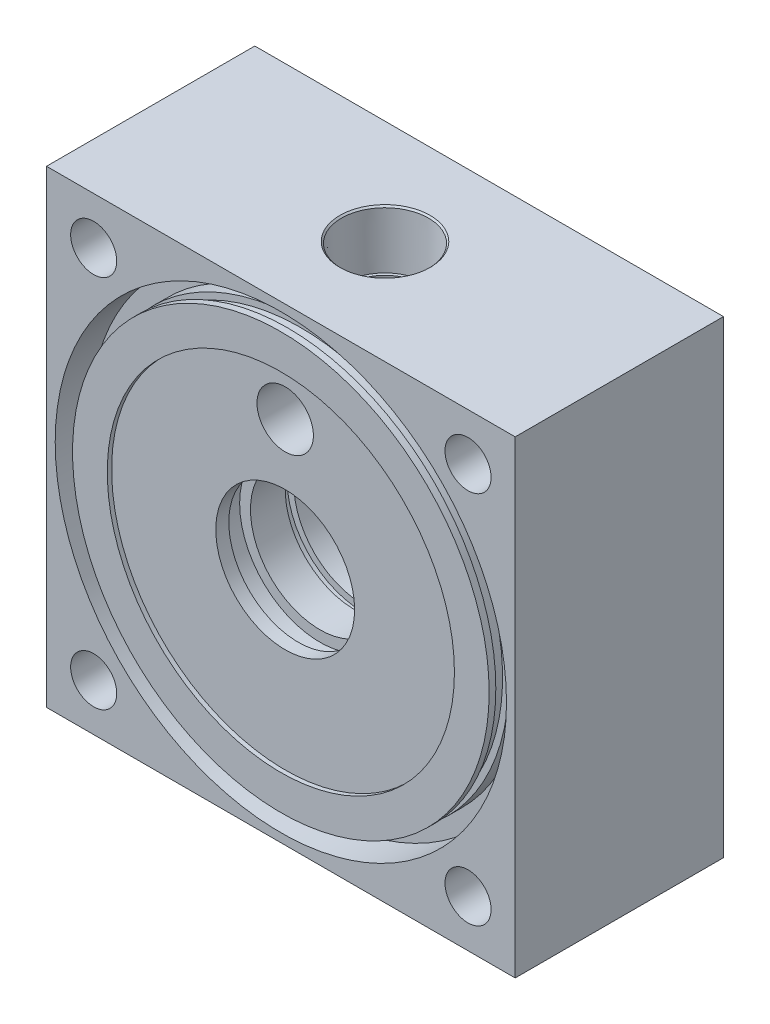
ISO-10303-21;
HEADER;
FILE_DESCRIPTION(('STEP AP214'),'2;1');
FILE_NAME('part.step','',(''),(''),'','','');
FILE_SCHEMA(('AUTOMOTIVE_DESIGN { 1 0 10303 214 1 1 1 1 }'));
ENDSEC;
DATA;
#1=APPLICATION_CONTEXT('core data for automotive mechanical design processes');
#2=APPLICATION_PROTOCOL_DEFINITION('international standard','automotive_design',2000,#1);
#3=PRODUCT_CONTEXT('',#1,'mechanical');
#4=PRODUCT('Part','Part','',(#3));
#5=PRODUCT_RELATED_PRODUCT_CATEGORY('part','',(#4));
#6=PRODUCT_DEFINITION_FORMATION('','',#4);
#7=PRODUCT_DEFINITION_CONTEXT('part definition',#1,'design');
#8=PRODUCT_DEFINITION('design','',#6,#7);
#9=PRODUCT_DEFINITION_SHAPE('','',#8);
#10=(LENGTH_UNIT() NAMED_UNIT(*) SI_UNIT(.MILLI.,.METRE.));
#11=(NAMED_UNIT(*) PLANE_ANGLE_UNIT() SI_UNIT($,.RADIAN.));
#12=(NAMED_UNIT(*) SI_UNIT($,.STERADIAN.) SOLID_ANGLE_UNIT());
#13=UNCERTAINTY_MEASURE_WITH_UNIT(LENGTH_MEASURE(1.E-05),#10,'distance_accuracy_value','');
#14=(GEOMETRIC_REPRESENTATION_CONTEXT(3) GLOBAL_UNCERTAINTY_ASSIGNED_CONTEXT((#13)) GLOBAL_UNIT_ASSIGNED_CONTEXT((#10,
#11,#12)) REPRESENTATION_CONTEXT('',''));
#15=CARTESIAN_POINT('',(0.,0.,0.));
#16=DIRECTION('',(0.,0.,1.));
#17=DIRECTION('',(1.,0.,0.));
#18=AXIS2_PLACEMENT_3D('',#15,#16,#17);
#19=CARTESIAN_POINT('',(0.,0.,0.));
#20=DIRECTION('',(0.,0.,1.));
#21=DIRECTION('',(1.,0.,0.));
#22=AXIS2_PLACEMENT_3D('',#19,#20,#21);
#23=CYLINDRICAL_SURFACE('',#22,12.7);
#24=CARTESIAN_POINT('',(0.,0.,23.01875));
#25=DIRECTION('',(0.,0.,-1.));
#26=DIRECTION('',(-1.,0.,0.));
#27=AXIS2_PLACEMENT_3D('',#24,#25,#26);
#28=CIRCLE('',#27,12.7);
#29=CARTESIAN_POINT('',(12.7,0.,23.01875));
#30=VERTEX_POINT('',#29);
#31=EDGE_CURVE('E155',#30,#30,#28,.T.);
#32=CARTESIAN_POINT('',(0.,0.,19.05));
#33=DIRECTION('',(0.,0.,-1.));
#34=DIRECTION('',(-1.,0.,0.));
#35=AXIS2_PLACEMENT_3D('',#32,#33,#34);
#36=CIRCLE('',#35,12.7);
#37=CARTESIAN_POINT('',(12.7,0.,19.05));
#38=VERTEX_POINT('',#37);
#39=EDGE_CURVE('E154',#38,#38,#36,.F.);
#40=CARTESIAN_POINT('',(12.7,0.,23.01875));
#41=CARTESIAN_POINT('',(12.7,0.,22.9774088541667));
#42=CARTESIAN_POINT('',(12.7,0.,22.9360677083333));
#43=CARTESIAN_POINT('',(12.7,0.,22.8533854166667));
#44=CARTESIAN_POINT('',(12.7,0.,22.8120442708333));
#45=CARTESIAN_POINT('',(12.7,0.,22.7293619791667));
#46=CARTESIAN_POINT('',(12.7,0.,22.6880208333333));
#47=CARTESIAN_POINT('',(12.7,0.,22.6053385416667));
#48=CARTESIAN_POINT('',(12.7,0.,22.5639973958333));
#49=CARTESIAN_POINT('',(12.7,0.,22.4813151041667));
#50=CARTESIAN_POINT('',(12.7,0.,22.4399739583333));
#51=CARTESIAN_POINT('',(12.7,0.,22.3572916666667));
#52=CARTESIAN_POINT('',(12.7,0.,22.3159505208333));
#53=CARTESIAN_POINT('',(12.7,0.,22.2332682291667));
#54=CARTESIAN_POINT('',(12.7,0.,22.1919270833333));
#55=CARTESIAN_POINT('',(12.7,0.,22.1092447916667));
#56=CARTESIAN_POINT('',(12.7,0.,22.0679036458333));
#57=CARTESIAN_POINT('',(12.7,0.,21.9852213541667));
#58=CARTESIAN_POINT('',(12.7,0.,21.9438802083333));
#59=CARTESIAN_POINT('',(12.7,0.,21.8611979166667));
#60=CARTESIAN_POINT('',(12.7,0.,21.8198567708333));
#61=CARTESIAN_POINT('',(12.7,0.,21.7371744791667));
#62=CARTESIAN_POINT('',(12.7,0.,21.6958333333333));
#63=CARTESIAN_POINT('',(12.7,0.,21.6131510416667));
#64=CARTESIAN_POINT('',(12.7,0.,21.5718098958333));
#65=CARTESIAN_POINT('',(12.7,0.,21.4891276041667));
#66=CARTESIAN_POINT('',(12.7,0.,21.4477864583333));
#67=CARTESIAN_POINT('',(12.7,0.,21.3651041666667));
#68=CARTESIAN_POINT('',(12.7,0.,21.3237630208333));
#69=CARTESIAN_POINT('',(12.7,0.,21.2410807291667));
#70=CARTESIAN_POINT('',(12.7,0.,21.1997395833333));
#71=CARTESIAN_POINT('',(12.7,0.,21.1170572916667));
#72=CARTESIAN_POINT('',(12.7,0.,21.0757161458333));
#73=CARTESIAN_POINT('',(12.7,0.,20.9930338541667));
#74=CARTESIAN_POINT('',(12.7,0.,20.9516927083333));
#75=CARTESIAN_POINT('',(12.7,0.,20.8690104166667));
#76=CARTESIAN_POINT('',(12.7,0.,20.8276692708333));
#77=CARTESIAN_POINT('',(12.7,0.,20.7449869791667));
#78=CARTESIAN_POINT('',(12.7,0.,20.7036458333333));
#79=CARTESIAN_POINT('',(12.7,0.,20.6209635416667));
#80=CARTESIAN_POINT('',(12.7,0.,20.5796223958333));
#81=CARTESIAN_POINT('',(12.7,0.,20.4969401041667));
#82=CARTESIAN_POINT('',(12.7,0.,20.4555989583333));
#83=CARTESIAN_POINT('',(12.7,0.,20.3729166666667));
#84=CARTESIAN_POINT('',(12.7,0.,20.3315755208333));
#85=CARTESIAN_POINT('',(12.7,0.,20.2488932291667));
#86=CARTESIAN_POINT('',(12.7,0.,20.2075520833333));
#87=CARTESIAN_POINT('',(12.7,0.,20.1248697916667));
#88=CARTESIAN_POINT('',(12.7,0.,20.0835286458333));
#89=CARTESIAN_POINT('',(12.7,0.,20.0008463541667));
#90=CARTESIAN_POINT('',(12.7,0.,19.9595052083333));
#91=CARTESIAN_POINT('',(12.7,0.,19.8768229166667));
#92=CARTESIAN_POINT('',(12.7,0.,19.8354817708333));
#93=CARTESIAN_POINT('',(12.7,0.,19.7527994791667));
#94=CARTESIAN_POINT('',(12.7,0.,19.7114583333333));
#95=CARTESIAN_POINT('',(12.7,0.,19.6287760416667));
#96=CARTESIAN_POINT('',(12.7,0.,19.5874348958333));
#97=CARTESIAN_POINT('',(12.7,0.,19.5047526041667));
#98=CARTESIAN_POINT('',(12.7,0.,19.4634114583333));
#99=CARTESIAN_POINT('',(12.7,0.,19.3807291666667));
#100=CARTESIAN_POINT('',(12.7,0.,19.3393880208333));
#101=CARTESIAN_POINT('',(12.7,0.,19.2567057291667));
#102=CARTESIAN_POINT('',(12.7,0.,19.2153645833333));
#103=CARTESIAN_POINT('',(12.7,0.,19.1326822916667));
#104=CARTESIAN_POINT('',(12.7,0.,19.0913411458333));
#105=CARTESIAN_POINT('',(12.7,0.,19.05));
#106=B_SPLINE_CURVE_WITH_KNOTS('',3,(#40,#41,#42,#43,#44,#45,#46,#47,#48,#49,#50,#51,#52,#53,
#54,#55,#56,#57,#58,#59,#60,#61,#62,#63,#64,#65,#66,#67,#68,#69,#70,#71,#72,#73,#74,#75,#76,#77,
#78,#79,#80,#81,#82,#83,#84,#85,#86,#87,#88,#89,#90,#91,#92,#93,#94,#95,#96,#97,#98,#99,#100,
#101,#102,#103,#104,#105),.UNSPECIFIED.,.F.,.F.,(4,2,2,2,2,2,2,2,2,2,2,2,2,2,2,2,2,2,2,2,2,2,2,
2,2,2,2,2,2,2,2,2,4),(0.,0.124023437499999,0.248046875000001,0.3720703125,0.496093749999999,
0.620117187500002,0.744140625,0.868164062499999,0.992187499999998,1.1162109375,1.240234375,
1.3642578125,1.48828125,1.6123046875,1.736328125,1.8603515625,1.984375,2.1083984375,2.232421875,
2.3564453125,2.48046875,2.6044921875,2.728515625,2.8525390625,2.9765625,3.1005859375,
3.224609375,3.3486328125,3.47265625,3.5966796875,3.720703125,3.8447265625,3.96875),.UNSPECIFIED.);
#107=EDGE_CURVE('BSEAM32',#30,#38,#106,.T.);
#108=ORIENTED_EDGE('',*,*,#31,.F.);
#109=ORIENTED_EDGE('',*,*,#39,.F.);
#110=ORIENTED_EDGE('',*,*,#107,.T.);
#111=ORIENTED_EDGE('',*,*,#107,.F.);
#112=EDGE_LOOP('',(#108,#110,#109,#111));
#113=FACE_BOUND('',#112,.T.);
#114=ADVANCED_FACE('F32',(#113),#23,.F.);
#115=CARTESIAN_POINT('',(0.,0.,24.60625));
#116=DIRECTION('',(0.,0.,-1.));
#117=DIRECTION('',(-1.,0.,0.));
#118=AXIS2_PLACEMENT_3D('',#115,#116,#117);
#119=CIRCLE('',#118,12.7);
#120=CARTESIAN_POINT('',(12.7,0.,24.60625));
#121=VERTEX_POINT('',#120);
#122=EDGE_CURVE('E164',#121,#121,#119,.T.);
#123=CARTESIAN_POINT('',(0.,0.,30.95625));
#124=DIRECTION('',(0.,0.,-1.));
#125=DIRECTION('',(-1.,0.,0.));
#126=AXIS2_PLACEMENT_3D('',#123,#124,#125);
#127=CIRCLE('',#126,12.7);
#128=CARTESIAN_POINT('',(12.7,0.,30.95625));
#129=VERTEX_POINT('',#128);
#130=EDGE_CURVE('E167',#129,#129,#127,.T.);
#131=CARTESIAN_POINT('',(12.7,0.,24.60625));
#132=CARTESIAN_POINT('',(12.7,0.,24.6723958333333));
#133=CARTESIAN_POINT('',(12.7,0.,24.7385416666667));
#134=CARTESIAN_POINT('',(12.7,0.,24.8708333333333));
#135=CARTESIAN_POINT('',(12.7,0.,24.9369791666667));
#136=CARTESIAN_POINT('',(12.7,0.,25.0692708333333));
#137=CARTESIAN_POINT('',(12.7,0.,25.1354166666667));
#138=CARTESIAN_POINT('',(12.7,0.,25.2677083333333));
#139=CARTESIAN_POINT('',(12.7,0.,25.3338541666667));
#140=CARTESIAN_POINT('',(12.7,0.,25.4661458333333));
#141=CARTESIAN_POINT('',(12.7,0.,25.5322916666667));
#142=CARTESIAN_POINT('',(12.7,0.,25.6645833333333));
#143=CARTESIAN_POINT('',(12.7,0.,25.7307291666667));
#144=CARTESIAN_POINT('',(12.7,0.,25.8630208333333));
#145=CARTESIAN_POINT('',(12.7,0.,25.9291666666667));
#146=CARTESIAN_POINT('',(12.7,0.,26.0614583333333));
#147=CARTESIAN_POINT('',(12.7,0.,26.1276041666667));
#148=CARTESIAN_POINT('',(12.7,0.,26.2598958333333));
#149=CARTESIAN_POINT('',(12.7,0.,26.3260416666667));
#150=CARTESIAN_POINT('',(12.7,0.,26.4583333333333));
#151=CARTESIAN_POINT('',(12.7,0.,26.5244791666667));
#152=CARTESIAN_POINT('',(12.7,0.,26.6567708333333));
#153=CARTESIAN_POINT('',(12.7,0.,26.7229166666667));
#154=CARTESIAN_POINT('',(12.7,0.,26.8552083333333));
#155=CARTESIAN_POINT('',(12.7,0.,26.9213541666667));
#156=CARTESIAN_POINT('',(12.7,0.,27.0536458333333));
#157=CARTESIAN_POINT('',(12.7,0.,27.1197916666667));
#158=CARTESIAN_POINT('',(12.7,0.,27.2520833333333));
#159=CARTESIAN_POINT('',(12.7,0.,27.3182291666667));
#160=CARTESIAN_POINT('',(12.7,0.,27.4505208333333));
#161=CARTESIAN_POINT('',(12.7,0.,27.5166666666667));
#162=CARTESIAN_POINT('',(12.7,0.,27.6489583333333));
#163=CARTESIAN_POINT('',(12.7,0.,27.7151041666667));
#164=CARTESIAN_POINT('',(12.7,0.,27.8473958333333));
#165=CARTESIAN_POINT('',(12.7,0.,27.9135416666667));
#166=CARTESIAN_POINT('',(12.7,0.,28.0458333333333));
#167=CARTESIAN_POINT('',(12.7,0.,28.1119791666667));
#168=CARTESIAN_POINT('',(12.7,0.,28.2442708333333));
#169=CARTESIAN_POINT('',(12.7,0.,28.3104166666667));
#170=CARTESIAN_POINT('',(12.7,0.,28.4427083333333));
#171=CARTESIAN_POINT('',(12.7,0.,28.5088541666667));
#172=CARTESIAN_POINT('',(12.7,0.,28.6411458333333));
#173=CARTESIAN_POINT('',(12.7,0.,28.7072916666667));
#174=CARTESIAN_POINT('',(12.7,0.,28.8395833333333));
#175=CARTESIAN_POINT('',(12.7,0.,28.9057291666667));
#176=CARTESIAN_POINT('',(12.7,0.,29.0380208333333));
#177=CARTESIAN_POINT('',(12.7,0.,29.1041666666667));
#178=CARTESIAN_POINT('',(12.7,0.,29.2364583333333));
#179=CARTESIAN_POINT('',(12.7,0.,29.3026041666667));
#180=CARTESIAN_POINT('',(12.7,0.,29.4348958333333));
#181=CARTESIAN_POINT('',(12.7,0.,29.5010416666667));
#182=CARTESIAN_POINT('',(12.7,0.,29.6333333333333));
#183=CARTESIAN_POINT('',(12.7,0.,29.6994791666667));
#184=CARTESIAN_POINT('',(12.7,0.,29.8317708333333));
#185=CARTESIAN_POINT('',(12.7,0.,29.8979166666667));
#186=CARTESIAN_POINT('',(12.7,0.,30.0302083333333));
#187=CARTESIAN_POINT('',(12.7,0.,30.0963541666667));
#188=CARTESIAN_POINT('',(12.7,0.,30.2286458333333));
#189=CARTESIAN_POINT('',(12.7,0.,30.2947916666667));
#190=CARTESIAN_POINT('',(12.7,0.,30.4270833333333));
#191=CARTESIAN_POINT('',(12.7,0.,30.4932291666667));
#192=CARTESIAN_POINT('',(12.7,0.,30.6255208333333));
#193=CARTESIAN_POINT('',(12.7,0.,30.6916666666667));
#194=CARTESIAN_POINT('',(12.7,0.,30.8239583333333));
#195=CARTESIAN_POINT('',(12.7,0.,30.8901041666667));
#196=CARTESIAN_POINT('',(12.7,0.,30.95625));
#197=B_SPLINE_CURVE_WITH_KNOTS('',3,(#131,#132,#133,#134,#135,#136,#137,#138,#139,#140,#141,
#142,#143,#144,#145,#146,#147,#148,#149,#150,#151,#152,#153,#154,#155,#156,#157,#158,#159,#160,
#161,#162,#163,#164,#165,#166,#167,#168,#169,#170,#171,#172,#173,#174,#175,#176,#177,#178,#179,
#180,#181,#182,#183,#184,#185,#186,#187,#188,#189,#190,#191,#192,#193,#194,#195,#196),
.UNSPECIFIED.,.F.,.F.,(4,2,2,2,2,2,2,2,2,2,2,2,2,2,2,2,2,2,2,2,2,2,2,2,2,2,2,2,2,2,2,2,4),(0.,
0.198437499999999,0.396874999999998,0.5953125,0.793749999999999,0.992187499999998,1.190625,
1.3890625,1.5875,1.7859375,1.984375,2.1828125,2.38125,2.5796875,2.778125,2.9765625,3.175,
3.3734375,3.571875,3.7703125,3.96875,4.1671875,4.365625,4.5640625,4.7625,4.96093749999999,
5.15937499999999,5.3578125,5.55625,5.75468749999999,5.953125,6.1515625,6.34999999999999),.UNSPECIFIED.);
#198=EDGE_CURVE('BSEAM294',#121,#129,#197,.T.);
#199=ORIENTED_EDGE('',*,*,#122,.T.);
#200=ORIENTED_EDGE('',*,*,#130,.F.);
#201=ORIENTED_EDGE('',*,*,#198,.T.);
#202=ORIENTED_EDGE('',*,*,#198,.F.);
#203=EDGE_LOOP('',(#199,#201,#200,#202));
#204=FACE_BOUND('',#203,.T.);
#205=ADVANCED_FACE('F294',(#204),#23,.F.);
#206=CARTESIAN_POINT('',(0.,0.,34.925));
#207=DIRECTION('',(0.,0.,-1.));
#208=DIRECTION('',(-1.,0.,0.));
#209=AXIS2_PLACEMENT_3D('',#206,#207,#208);
#210=CIRCLE('',#209,12.7);
#211=CARTESIAN_POINT('',(12.7,0.,34.925));
#212=VERTEX_POINT('',#211);
#213=EDGE_CURVE('E176',#212,#212,#210,.T.);
#214=CARTESIAN_POINT('',(0.,0.,37.30625));
#215=DIRECTION('',(0.,0.,1.));
#216=DIRECTION('',(1.,0.,0.));
#217=AXIS2_PLACEMENT_3D('',#214,#215,#216);
#218=CIRCLE('',#217,12.7);
#219=CARTESIAN_POINT('',(12.7,0.,37.30625));
#220=VERTEX_POINT('',#219);
#221=EDGE_CURVE('E313',#220,#220,#218,.T.);
#222=CARTESIAN_POINT('',(12.7,0.,34.925));
#223=CARTESIAN_POINT('',(12.7,0.,34.9498046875));
#224=CARTESIAN_POINT('',(12.7,0.,34.974609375));
#225=CARTESIAN_POINT('',(12.7,0.,35.02421875));
#226=CARTESIAN_POINT('',(12.7,0.,35.0490234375));
#227=CARTESIAN_POINT('',(12.7,0.,35.0986328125));
#228=CARTESIAN_POINT('',(12.7,0.,35.1234375));
#229=CARTESIAN_POINT('',(12.7,0.,35.173046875));
#230=CARTESIAN_POINT('',(12.7,0.,35.1978515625));
#231=CARTESIAN_POINT('',(12.7,0.,35.2474609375));
#232=CARTESIAN_POINT('',(12.7,0.,35.272265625));
#233=CARTESIAN_POINT('',(12.7,0.,35.321875));
#234=CARTESIAN_POINT('',(12.7,0.,35.3466796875));
#235=CARTESIAN_POINT('',(12.7,0.,35.3962890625));
#236=CARTESIAN_POINT('',(12.7,0.,35.42109375));
#237=CARTESIAN_POINT('',(12.7,0.,35.470703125));
#238=CARTESIAN_POINT('',(12.7,0.,35.4955078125));
#239=CARTESIAN_POINT('',(12.7,0.,35.5451171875));
#240=CARTESIAN_POINT('',(12.7,0.,35.569921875));
#241=CARTESIAN_POINT('',(12.7,0.,35.61953125));
#242=CARTESIAN_POINT('',(12.7,0.,35.6443359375));
#243=CARTESIAN_POINT('',(12.7,0.,35.6939453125));
#244=CARTESIAN_POINT('',(12.7,0.,35.71875));
#245=CARTESIAN_POINT('',(12.7,0.,35.768359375));
#246=CARTESIAN_POINT('',(12.7,0.,35.7931640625));
#247=CARTESIAN_POINT('',(12.7,0.,35.8427734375));
#248=CARTESIAN_POINT('',(12.7,0.,35.867578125));
#249=CARTESIAN_POINT('',(12.7,0.,35.9171875));
#250=CARTESIAN_POINT('',(12.7,0.,35.9419921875));
#251=CARTESIAN_POINT('',(12.7,0.,35.9916015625));
#252=CARTESIAN_POINT('',(12.7,0.,36.01640625));
#253=CARTESIAN_POINT('',(12.7,0.,36.066015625));
#254=CARTESIAN_POINT('',(12.7,0.,36.0908203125));
#255=CARTESIAN_POINT('',(12.7,0.,36.1404296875));
#256=CARTESIAN_POINT('',(12.7,0.,36.165234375));
#257=CARTESIAN_POINT('',(12.7,0.,36.21484375));
#258=CARTESIAN_POINT('',(12.7,0.,36.2396484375));
#259=CARTESIAN_POINT('',(12.7,0.,36.2892578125));
#260=CARTESIAN_POINT('',(12.7,0.,36.3140625));
#261=CARTESIAN_POINT('',(12.7,0.,36.363671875));
#262=CARTESIAN_POINT('',(12.7,0.,36.3884765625));
#263=CARTESIAN_POINT('',(12.7,0.,36.4380859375));
#264=CARTESIAN_POINT('',(12.7,0.,36.462890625));
#265=CARTESIAN_POINT('',(12.7,0.,36.5125));
#266=CARTESIAN_POINT('',(12.7,0.,36.5373046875));
#267=CARTESIAN_POINT('',(12.7,0.,36.5869140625));
#268=CARTESIAN_POINT('',(12.7,0.,36.61171875));
#269=CARTESIAN_POINT('',(12.7,0.,36.661328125));
#270=CARTESIAN_POINT('',(12.7,0.,36.6861328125));
#271=CARTESIAN_POINT('',(12.7,0.,36.7357421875));
#272=CARTESIAN_POINT('',(12.7,0.,36.760546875));
#273=CARTESIAN_POINT('',(12.7,0.,36.81015625));
#274=CARTESIAN_POINT('',(12.7,0.,36.8349609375));
#275=CARTESIAN_POINT('',(12.7,0.,36.8845703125));
#276=CARTESIAN_POINT('',(12.7,0.,36.909375));
#277=CARTESIAN_POINT('',(12.7,0.,36.958984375));
#278=CARTESIAN_POINT('',(12.7,0.,36.9837890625));
#279=CARTESIAN_POINT('',(12.7,0.,37.0333984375));
#280=CARTESIAN_POINT('',(12.7,0.,37.058203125));
#281=CARTESIAN_POINT('',(12.7,0.,37.1078125));
#282=CARTESIAN_POINT('',(12.7,0.,37.1326171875));
#283=CARTESIAN_POINT('',(12.7,0.,37.1822265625));
#284=CARTESIAN_POINT('',(12.7,0.,37.20703125));
#285=CARTESIAN_POINT('',(12.7,0.,37.256640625));
#286=CARTESIAN_POINT('',(12.7,0.,37.2814453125));
#287=CARTESIAN_POINT('',(12.7,0.,37.30625));
#288=B_SPLINE_CURVE_WITH_KNOTS('',3,(#222,#223,#224,#225,#226,#227,#228,#229,#230,#231,#232,
#233,#234,#235,#236,#237,#238,#239,#240,#241,#242,#243,#244,#245,#246,#247,#248,#249,#250,#251,
#252,#253,#254,#255,#256,#257,#258,#259,#260,#261,#262,#263,#264,#265,#266,#267,#268,#269,#270,
#271,#272,#273,#274,#275,#276,#277,#278,#279,#280,#281,#282,#283,#284,#285,#286,#287),
.UNSPECIFIED.,.F.,.F.,(4,2,2,2,2,2,2,2,2,2,2,2,2,2,2,2,2,2,2,2,2,2,2,2,2,2,2,2,2,2,2,2,4),(0.,
0.0744140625,0.148828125,0.2232421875,0.29765625,0.3720703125,0.446484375,0.5208984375,
0.5953125,0.669726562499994,0.744140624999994,0.818554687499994,0.892968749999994,
0.967382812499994,1.04179687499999,1.11621093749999,1.19062499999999,1.26503906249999,
1.33945312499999,1.41386718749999,1.48828124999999,1.56269531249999,1.63710937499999,
1.71152343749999,1.78593749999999,1.86035156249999,1.93476562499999,2.00917968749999,
2.08359374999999,2.15800781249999,2.23242187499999,2.30683593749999,2.38124999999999),.UNSPECIFIED.);
#289=EDGE_CURVE('BSEAM296',#212,#220,#288,.T.);
#290=ORIENTED_EDGE('',*,*,#213,.T.);
#291=ORIENTED_EDGE('',*,*,#221,.T.);
#292=ORIENTED_EDGE('',*,*,#289,.T.);
#293=ORIENTED_EDGE('',*,*,#289,.F.);
#294=EDGE_LOOP('',(#290,#292,#291,#293));
#295=FACE_BOUND('',#294,.T.);
#296=ADVANCED_FACE('F296',(#295),#23,.F.);
#297=CARTESIAN_POINT('',(0.,0.,31.75));
#298=DIRECTION('',(0.,0.,1.));
#299=DIRECTION('',(1.,0.,0.));
#300=AXIS2_PLACEMENT_3D('',#297,#298,#299);
#301=CYLINDRICAL_SURFACE('',#300,38.1);
#302=CARTESIAN_POINT('',(0.,0.,36.8808));
#303=DIRECTION('',(0.,0.,-1.));
#304=DIRECTION('',(-1.,0.,0.));
#305=AXIS2_PLACEMENT_3D('',#302,#303,#304);
#306=CIRCLE('',#305,38.1);
#307=CARTESIAN_POINT('',(-38.1,0.,36.8808));
#308=VERTEX_POINT('',#307);
#309=EDGE_CURVE('E188',#308,#308,#306,.T.);
#310=ORIENTED_EDGE('',*,*,#309,.F.);
#311=EDGE_LOOP('',(#310));
#312=FACE_BOUND('',#311,.T.);
#313=CARTESIAN_POINT('',(0.,0.,38.1));
#314=DIRECTION('',(0.,0.,1.));
#315=DIRECTION('',(1.,0.,0.));
#316=AXIS2_PLACEMENT_3D('',#313,#314,#315);
#317=CIRCLE('',#316,38.1);
#318=CARTESIAN_POINT('',(38.1,0.,38.1));
#319=VERTEX_POINT('',#318);
#320=EDGE_CURVE('E422',#319,#319,#317,.T.);
#321=ORIENTED_EDGE('',*,*,#320,.F.);
#322=EDGE_LOOP('',(#321));
#323=FACE_BOUND('',#322,.T.);
#324=ADVANCED_FACE('F263',(#312,#323),#301,.T.);
#325=CARTESIAN_POINT('',(0.,23.8125,19.05));
#326=DIRECTION('',(0.,1.,0.));
#327=DIRECTION('',(0.,0.,1.));
#328=AXIS2_PLACEMENT_3D('',#325,#326,#327);
#329=CONICAL_SURFACE('',#328,7.1374,1.02974425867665);
#330=CARTESIAN_POINT('',(0.,23.8125,19.05));
#331=DIRECTION('',(0.,1.,0.));
#332=DIRECTION('',(0.,0.,1.));
#333=AXIS2_PLACEMENT_3D('',#330,#331,#332);
#334=CIRCLE('',#333,7.1374);
#335=CARTESIAN_POINT('',(-5.1593242,23.8125,14.1180782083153));
#336=VERTEX_POINT('',#335);
#337=CARTESIAN_POINT('',(-5.1593242,23.8125,23.9819217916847));
#338=VERTEX_POINT('',#337);
#339=EDGE_CURVE('E441',#336,#338,#334,.T.);
#340=ORIENTED_EDGE('',*,*,#339,.T.);
#341=CARTESIAN_POINT('',(-5.14145263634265,24.2415582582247,24.9838933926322));
#342=CARTESIAN_POINT('',(-5.14751890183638,24.1689575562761,24.8187287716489));
#343=CARTESIAN_POINT('',(-5.15196823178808,24.0969950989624,24.6532239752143));
#344=CARTESIAN_POINT('',(-5.15785228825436,23.9547432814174,24.321433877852));
#345=CARTESIAN_POINT('',(-5.15928686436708,23.8844540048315,24.1551485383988));
#346=CARTESIAN_POINT('',(-5.15936020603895,23.7457884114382,23.8213186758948));
#347=CARTESIAN_POINT('',(-5.15799233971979,23.6774170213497,23.6537721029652));
#348=CARTESIAN_POINT('',(-5.15273335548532,23.5433052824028,23.3176705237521));
#349=CARTESIAN_POINT('',(-5.14884228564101,23.4775648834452,23.1491155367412));
#350=CARTESIAN_POINT('',(-5.13890216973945,23.3494258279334,22.8108516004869));
#351=CARTESIAN_POINT('',(-5.13285371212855,23.2870262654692,22.6411429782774));
#352=CARTESIAN_POINT('',(-5.1190757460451,23.1664588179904,22.3002995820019));
#353=CARTESIAN_POINT('',(-5.11134631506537,23.1082907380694,22.1291648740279));
#354=CARTESIAN_POINT('',(-5.09483724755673,22.9973930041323,21.7852834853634));
#355=CARTESIAN_POINT('',(-5.0860582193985,22.9446602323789,21.6125377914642));
#356=CARTESIAN_POINT('',(-5.06825622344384,22.8461088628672,21.2651222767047));
#357=CARTESIAN_POINT('',(-5.05923329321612,22.8002892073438,21.0904527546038));
#358=CARTESIAN_POINT('',(-5.03913364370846,22.7039365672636,20.6818576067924));
#359=CARTESIAN_POINT('',(-5.02834094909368,22.6567013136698,20.4471012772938));
#360=CARTESIAN_POINT('',(-5.01509071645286,22.6009483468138,20.0925668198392));
#361=CARTESIAN_POINT('',(-5.01116435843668,22.5848827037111,19.9740171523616));
#362=CARTESIAN_POINT('',(-5.00457781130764,22.5583007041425,19.7362688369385));
#363=CARTESIAN_POINT('',(-5.0019174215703,22.5477834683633,19.6170702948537));
#364=CARTESIAN_POINT('',(-4.99807997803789,22.5327014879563,19.3784573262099));
#365=CARTESIAN_POINT('',(-4.99690060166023,22.5281274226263,19.2590435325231));
#366=CARTESIAN_POINT('',(-4.99611722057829,22.5250833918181,19.0201329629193));
#367=CARTESIAN_POINT('',(-4.99651320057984,22.5266133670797,18.9006361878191));
#368=CARTESIAN_POINT('',(-4.99884709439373,22.5357166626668,18.6618811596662));
#369=CARTESIAN_POINT('',(-5.00078512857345,22.5432904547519,18.5426229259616));
#370=CARTESIAN_POINT('',(-5.00604138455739,22.5641853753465,18.3046357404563));
#371=CARTESIAN_POINT('',(-5.00935979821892,22.5775073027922,18.1859068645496));
#372=CARTESIAN_POINT('',(-5.02022809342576,22.6221989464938,17.8546416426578));
#373=CARTESIAN_POINT('',(-5.0290405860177,22.6594845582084,17.6429366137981));
#374=CARTESIAN_POINT('',(-5.04846956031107,22.7477927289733,17.222483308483));
#375=CARTESIAN_POINT('',(-5.05908705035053,22.7988229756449,17.0137367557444));
#376=CARTESIAN_POINT('',(-5.08037487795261,22.9115447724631,16.5982701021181));
#377=CARTESIAN_POINT('',(-5.09104525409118,22.9732790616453,16.3915617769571));
#378=CARTESIAN_POINT('',(-5.11095808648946,23.1045840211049,15.9806523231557));
#379=CARTESIAN_POINT('',(-5.12020080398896,23.174153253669,15.7764507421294));
#380=CARTESIAN_POINT('',(-5.13642852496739,23.3212166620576,15.3642286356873));
#381=CARTESIAN_POINT('',(-5.14334127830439,23.3988807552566,15.1562662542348));
#382=CARTESIAN_POINT('',(-5.15370801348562,23.5588256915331,14.742031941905));
#383=CARTESIAN_POINT('',(-5.15716180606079,23.6411067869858,14.5357601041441));
#384=CARTESIAN_POINT('',(-5.15999282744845,23.8083202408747,14.1265837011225));
#385=CARTESIAN_POINT('',(-5.159408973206,23.8932194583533,13.923665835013));
#386=CARTESIAN_POINT('',(-5.15383750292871,24.0656246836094,13.5190358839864));
#387=CARTESIAN_POINT('',(-5.14885052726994,24.1531303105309,13.3173236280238));
#388=CARTESIAN_POINT('',(-5.14145263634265,24.2415582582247,13.1161066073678));
#389=B_SPLINE_CURVE_WITH_KNOTS('',3,(#341,#342,#343,#344,#345,#346,#347,#348,#349,#350,#351,
#352,#353,#354,#355,#356,#357,#358,#359,#360,#361,#362,#363,#364,#365,#366,#367,#368,#369,#370,
#371,#372,#373,#374,#375,#376,#377,#378,#379,#380,#381,#382,#383,#384,#385,#386,#387,#388),
.UNSPECIFIED.,.F.,.F.,(4,2,2,2,2,2,2,2,2,2,2,2,2,2,2,2,2,2,2,2,2,2,2,4),(0.,0.541548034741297,
1.08312308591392,1.62598123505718,2.16882904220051,2.71152889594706,3.25420373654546,
3.79656554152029,4.33884427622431,5.05714413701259,5.4161233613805,5.77504567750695,
6.13340441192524,6.49175966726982,6.85014289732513,7.20857595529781,7.85334788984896,
8.4984812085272,9.14625236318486,9.79390484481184,10.4601079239,11.1263474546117,
11.7861744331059,12.4459054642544),.UNSPECIFIED.);
#390=EDGE_CURVE('E234',#338,#336,#389,.T.);
#391=ORIENTED_EDGE('',*,*,#390,.T.);
#392=EDGE_LOOP('',(#340,#391));
#393=FACE_BOUND('',#392,.T.);
#394=ADVANCED_FACE('F291',(#393),#329,.F.);
#395=CARTESIAN_POINT('',(-42.8625,-42.8625,38.1));
#396=DIRECTION('',(1.,0.,0.));
#397=DIRECTION('',(0.,0.,-1.));
#398=AXIS2_PLACEMENT_3D('',#395,#396,#397);
#399=PLANE('',#398);
#400=CARTESIAN_POINT('',(-42.8625,-22.225,19.05));
#401=DIRECTION('',(-1.,0.,0.));
#402=DIRECTION('',(0.,0.,1.));
#403=AXIS2_PLACEMENT_3D('',#400,#401,#402);
#404=CIRCLE('',#403,3.96874999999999);
#405=CARTESIAN_POINT('',(-42.8625,-22.225,23.01875));
#406=VERTEX_POINT('',#405);
#407=EDGE_CURVE('E111',#406,#406,#404,.T.);
#408=ORIENTED_EDGE('',*,*,#407,.F.);
#409=EDGE_LOOP('',(#408));
#410=FACE_BOUND('',#409,.T.);
#411=CARTESIAN_POINT('',(-42.8625,22.225,19.05));
#412=DIRECTION('',(-1.,0.,0.));
#413=DIRECTION('',(0.,0.,1.));
#414=AXIS2_PLACEMENT_3D('',#411,#412,#413);
#415=CIRCLE('',#414,3.96874999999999);
#416=CARTESIAN_POINT('',(-42.8625,22.225,23.01875));
#417=VERTEX_POINT('',#416);
#418=EDGE_CURVE('E110',#417,#417,#415,.T.);
#419=ORIENTED_EDGE('',*,*,#418,.F.);
#420=EDGE_LOOP('',(#419));
#421=FACE_BOUND('',#420,.T.);
#422=DIRECTION('',(0.,-1.,0.));
#423=VECTOR('',#422,1.);
#424=CARTESIAN_POINT('',(-42.8625,-42.8625,0.));
#425=LINE('',#424,#423);
#426=CARTESIAN_POINT('',(-42.8625,42.8625,0.));
#427=VERTEX_POINT('',#426);
#428=CARTESIAN_POINT('',(-42.8625,-42.8625,0.));
#429=VERTEX_POINT('',#428);
#430=EDGE_CURVE('E390',#427,#429,#425,.T.);
#431=ORIENTED_EDGE('',*,*,#430,.T.);
#432=DIRECTION('',(0.,0.,-1.));
#433=VECTOR('',#432,1.);
#434=CARTESIAN_POINT('',(-42.8625,-42.8625,38.1));
#435=LINE('',#434,#433);
#436=CARTESIAN_POINT('',(-42.8625,-42.8625,38.1));
#437=VERTEX_POINT('',#436);
#438=EDGE_CURVE('E11',#437,#429,#435,.T.);
#439=ORIENTED_EDGE('',*,*,#438,.F.);
#440=DIRECTION('',(0.,-1.,0.));
#441=VECTOR('',#440,1.);
#442=CARTESIAN_POINT('',(-42.8625,-42.8625,38.1));
#443=LINE('',#442,#441);
#444=CARTESIAN_POINT('',(-42.8625,42.8625,38.1));
#445=VERTEX_POINT('',#444);
#446=EDGE_CURVE('E407',#445,#437,#443,.T.);
#447=ORIENTED_EDGE('',*,*,#446,.F.);
#448=DIRECTION('',(0.,0.,-1.));
#449=VECTOR('',#448,1.);
#450=CARTESIAN_POINT('',(-42.8625,42.8625,38.1));
#451=LINE('',#450,#449);
#452=EDGE_CURVE('E408',#445,#427,#451,.T.);
#453=ORIENTED_EDGE('',*,*,#452,.T.);
#454=EDGE_LOOP('',(#431,#439,#447,#453));
#455=FACE_BOUND('',#454,.T.);
#456=ADVANCED_FACE('F34',(#410,#421,#455),#399,.F.);
#457=CARTESIAN_POINT('',(-42.8625,-42.8625,38.1));
#458=DIRECTION('',(0.,1.,0.));
#459=DIRECTION('',(0.,0.,1.));
#460=AXIS2_PLACEMENT_3D('',#457,#458,#459);
#461=PLANE('',#460);
#462=DIRECTION('',(1.,0.,0.));
#463=VECTOR('',#462,1.);
#464=CARTESIAN_POINT('',(-42.8625,-42.8625,0.));
#465=LINE('',#464,#463);
#466=CARTESIAN_POINT('',(42.8625,-42.8625,0.));
#467=VERTEX_POINT('',#466);
#468=EDGE_CURVE('E392',#429,#467,#465,.T.);
#469=ORIENTED_EDGE('',*,*,#468,.T.);
#470=DIRECTION('',(0.,0.,-1.));
#471=VECTOR('',#470,1.);
#472=CARTESIAN_POINT('',(42.8625,-42.8625,38.1));
#473=LINE('',#472,#471);
#474=CARTESIAN_POINT('',(42.8625,-42.8625,38.1));
#475=VERTEX_POINT('',#474);
#476=EDGE_CURVE('E41',#475,#467,#473,.T.);
#477=ORIENTED_EDGE('',*,*,#476,.F.);
#478=DIRECTION('',(1.,0.,0.));
#479=VECTOR('',#478,1.);
#480=CARTESIAN_POINT('',(-42.8625,-42.8625,38.1));
#481=LINE('',#480,#479);
#482=EDGE_CURVE('E86',#437,#475,#481,.T.);
#483=ORIENTED_EDGE('',*,*,#482,.F.);
#484=ORIENTED_EDGE('',*,*,#438,.T.);
#485=EDGE_LOOP('',(#469,#477,#483,#484));
#486=FACE_BOUND('',#485,.T.);
#487=ADVANCED_FACE('F285',(#486),#461,.F.);
#488=CARTESIAN_POINT('',(42.8625,-42.8625,38.1));
#489=DIRECTION('',(-1.,0.,0.));
#490=DIRECTION('',(0.,-1.,0.));
#491=AXIS2_PLACEMENT_3D('',#488,#489,#490);
#492=PLANE('',#491);
#493=DIRECTION('',(0.,1.,0.));
#494=VECTOR('',#493,1.);
#495=CARTESIAN_POINT('',(42.8625,-42.8625,0.));
#496=LINE('',#495,#494);
#497=CARTESIAN_POINT('',(42.8625,42.8625,0.));
#498=VERTEX_POINT('',#497);
#499=EDGE_CURVE('E397',#467,#498,#496,.T.);
#500=ORIENTED_EDGE('',*,*,#499,.T.);
#501=DIRECTION('',(0.,0.,-1.));
#502=VECTOR('',#501,1.);
#503=CARTESIAN_POINT('',(42.8625,42.8625,38.1));
#504=LINE('',#503,#502);
#505=CARTESIAN_POINT('',(42.8625,42.8625,38.1));
#506=VERTEX_POINT('',#505);
#507=EDGE_CURVE('E410',#506,#498,#504,.T.);
#508=ORIENTED_EDGE('',*,*,#507,.F.);
#509=DIRECTION('',(0.,1.,0.));
#510=VECTOR('',#509,1.);
#511=CARTESIAN_POINT('',(42.8625,-42.8625,38.1));
#512=LINE('',#511,#510);
#513=EDGE_CURVE('E414',#475,#506,#512,.T.);
#514=ORIENTED_EDGE('',*,*,#513,.F.);
#515=ORIENTED_EDGE('',*,*,#476,.T.);
#516=EDGE_LOOP('',(#500,#508,#514,#515));
#517=FACE_BOUND('',#516,.T.);
#518=ADVANCED_FACE('F282',(#517),#492,.F.);
#519=CARTESIAN_POINT('',(-42.8625,42.8625,38.1));
#520=DIRECTION('',(0.,-1.,0.));
#521=DIRECTION('',(0.,0.,-1.));
#522=AXIS2_PLACEMENT_3D('',#519,#520,#521);
#523=PLANE('',#522);
#524=CARTESIAN_POINT('',(0.,42.8625,19.05));
#525=DIRECTION('',(0.,1.,0.));
#526=DIRECTION('',(0.,0.,1.));
#527=AXIS2_PLACEMENT_3D('',#524,#525,#526);
#528=CIRCLE('',#527,8.255);
#529=CARTESIAN_POINT('',(0.,42.8625,27.305));
#530=VERTEX_POINT('',#529);
#531=EDGE_CURVE('E425',#530,#530,#528,.T.);
#532=ORIENTED_EDGE('',*,*,#531,.F.);
#533=EDGE_LOOP('',(#532));
#534=FACE_BOUND('',#533,.T.);
#535=DIRECTION('',(-1.,0.,0.));
#536=VECTOR('',#535,1.);
#537=CARTESIAN_POINT('',(-42.8625,42.8625,0.));
#538=LINE('',#537,#536);
#539=EDGE_CURVE('E79',#498,#427,#538,.T.);
#540=ORIENTED_EDGE('',*,*,#539,.T.);
#541=ORIENTED_EDGE('',*,*,#452,.F.);
#542=DIRECTION('',(-1.,0.,0.));
#543=VECTOR('',#542,1.);
#544=CARTESIAN_POINT('',(-42.8625,42.8625,38.1));
#545=LINE('',#544,#543);
#546=EDGE_CURVE('E58',#506,#445,#545,.T.);
#547=ORIENTED_EDGE('',*,*,#546,.F.);
#548=ORIENTED_EDGE('',*,*,#507,.T.);
#549=EDGE_LOOP('',(#540,#541,#547,#548));
#550=FACE_BOUND('',#549,.T.);
#551=ADVANCED_FACE('F275',(#534,#550),#523,.F.);
#552=CARTESIAN_POINT('',(-42.8625,42.8625,38.1));
#553=DIRECTION('',(0.,0.,-1.));
#554=DIRECTION('',(-1.,0.,0.));
#555=AXIS2_PLACEMENT_3D('',#552,#553,#554);
#556=PLANE('',#555);
#557=CARTESIAN_POINT('',(-34.2372264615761,34.2372264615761,38.1));
#558=DIRECTION('',(0.,0.,1.));
#559=DIRECTION('',(1.,0.,0.));
#560=AXIS2_PLACEMENT_3D('',#557,#558,#559);
#561=CIRCLE('',#560,4.21639999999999);
#562=CARTESIAN_POINT('',(-30.0208264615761,34.2372264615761,38.1));
#563=VERTEX_POINT('',#562);
#564=EDGE_CURVE('E121',#563,#563,#561,.T.);
#565=ORIENTED_EDGE('',*,*,#564,.F.);
#566=EDGE_LOOP('',(#565));
#567=FACE_BOUND('',#566,.T.);
#568=CARTESIAN_POINT('',(-34.2372264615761,-34.2372264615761,38.1));
#569=DIRECTION('',(0.,0.,1.));
#570=DIRECTION('',(1.,0.,0.));
#571=AXIS2_PLACEMENT_3D('',#568,#569,#570);
#572=CIRCLE('',#571,4.21639999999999);
#573=CARTESIAN_POINT('',(-30.0208264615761,-34.2372264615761,38.1));
#574=VERTEX_POINT('',#573);
#575=EDGE_CURVE('E127',#574,#574,#572,.T.);
#576=ORIENTED_EDGE('',*,*,#575,.F.);
#577=EDGE_LOOP('',(#576));
#578=FACE_BOUND('',#577,.T.);
#579=CARTESIAN_POINT('',(34.2372264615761,-34.2372264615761,38.1));
#580=DIRECTION('',(0.,0.,1.));
#581=DIRECTION('',(1.,0.,0.));
#582=AXIS2_PLACEMENT_3D('',#579,#580,#581);
#583=CIRCLE('',#582,4.21639999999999);
#584=CARTESIAN_POINT('',(38.4536264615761,-34.2372264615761,38.1));
#585=VERTEX_POINT('',#584);
#586=EDGE_CURVE('E133',#585,#585,#583,.T.);
#587=ORIENTED_EDGE('',*,*,#586,.F.);
#588=EDGE_LOOP('',(#587));
#589=FACE_BOUND('',#588,.T.);
#590=CARTESIAN_POINT('',(34.2372264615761,34.2372264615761,38.1));
#591=DIRECTION('',(0.,0.,1.));
#592=DIRECTION('',(1.,0.,0.));
#593=AXIS2_PLACEMENT_3D('',#590,#591,#592);
#594=CIRCLE('',#593,4.21639999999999);
#595=CARTESIAN_POINT('',(38.4536264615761,34.2372264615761,38.1));
#596=VERTEX_POINT('',#595);
#597=EDGE_CURVE('E139',#596,#596,#594,.T.);
#598=ORIENTED_EDGE('',*,*,#597,.F.);
#599=EDGE_LOOP('',(#598));
#600=FACE_BOUND('',#599,.T.);
#601=CARTESIAN_POINT('',(0.,0.,38.1));
#602=DIRECTION('',(0.,0.,1.));
#603=DIRECTION('',(1.,0.,0.));
#604=AXIS2_PLACEMENT_3D('',#601,#602,#603);
#605=CIRCLE('',#604,41.275);
#606=CARTESIAN_POINT('',(41.275,0.,38.1));
#607=VERTEX_POINT('',#606);
#608=EDGE_CURVE('E400',#607,#607,#605,.T.);
#609=ORIENTED_EDGE('',*,*,#608,.F.);
#610=EDGE_LOOP('',(#609));
#611=FACE_BOUND('',#610,.T.);
#612=ORIENTED_EDGE('',*,*,#446,.T.);
#613=ORIENTED_EDGE('',*,*,#482,.T.);
#614=ORIENTED_EDGE('',*,*,#513,.T.);
#615=ORIENTED_EDGE('',*,*,#546,.T.);
#616=EDGE_LOOP('',(#612,#613,#614,#615));
#617=FACE_BOUND('',#616,.T.);
#618=ADVANCED_FACE('F272',(#567,#578,#589,#600,#611,#617),#556,.F.);
#619=CARTESIAN_POINT('',(-42.8625,42.8625,0.));
#620=DIRECTION('',(0.,0.,-1.));
#621=DIRECTION('',(-1.,0.,0.));
#622=AXIS2_PLACEMENT_3D('',#619,#620,#621);
#623=PLANE('',#622);
#624=CARTESIAN_POINT('',(-34.2372264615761,34.2372264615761,0.));
#625=DIRECTION('',(0.,0.,1.));
#626=DIRECTION('',(1.,0.,0.));
#627=AXIS2_PLACEMENT_3D('',#624,#625,#626);
#628=CIRCLE('',#627,4.21639999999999);
#629=CARTESIAN_POINT('',(-30.0208264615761,34.2372264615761,0.));
#630=VERTEX_POINT('',#629);
#631=EDGE_CURVE('E124',#630,#630,#628,.T.);
#632=ORIENTED_EDGE('',*,*,#631,.T.);
#633=EDGE_LOOP('',(#632));
#634=FACE_BOUND('',#633,.T.);
#635=CARTESIAN_POINT('',(-34.2372264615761,-34.2372264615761,0.));
#636=DIRECTION('',(0.,0.,1.));
#637=DIRECTION('',(1.,0.,0.));
#638=AXIS2_PLACEMENT_3D('',#635,#636,#637);
#639=CIRCLE('',#638,4.21639999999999);
#640=CARTESIAN_POINT('',(-30.0208264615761,-34.2372264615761,0.));
#641=VERTEX_POINT('',#640);
#642=EDGE_CURVE('E130',#641,#641,#639,.T.);
#643=ORIENTED_EDGE('',*,*,#642,.T.);
#644=EDGE_LOOP('',(#643));
#645=FACE_BOUND('',#644,.T.);
#646=CARTESIAN_POINT('',(34.2372264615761,-34.2372264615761,0.));
#647=DIRECTION('',(0.,0.,1.));
#648=DIRECTION('',(1.,0.,0.));
#649=AXIS2_PLACEMENT_3D('',#646,#647,#648);
#650=CIRCLE('',#649,4.21639999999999);
#651=CARTESIAN_POINT('',(38.4536264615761,-34.2372264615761,0.));
#652=VERTEX_POINT('',#651);
#653=EDGE_CURVE('E136',#652,#652,#650,.T.);
#654=ORIENTED_EDGE('',*,*,#653,.T.);
#655=EDGE_LOOP('',(#654));
#656=FACE_BOUND('',#655,.T.);
#657=CARTESIAN_POINT('',(34.2372264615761,34.2372264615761,0.));
#658=DIRECTION('',(0.,0.,1.));
#659=DIRECTION('',(1.,0.,0.));
#660=AXIS2_PLACEMENT_3D('',#657,#658,#659);
#661=CIRCLE('',#660,4.21639999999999);
#662=CARTESIAN_POINT('',(38.4536264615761,34.2372264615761,0.));
#663=VERTEX_POINT('',#662);
#664=EDGE_CURVE('E142',#663,#663,#661,.T.);
#665=ORIENTED_EDGE('',*,*,#664,.T.);
#666=EDGE_LOOP('',(#665));
#667=FACE_BOUND('',#666,.T.);
#668=CARTESIAN_POINT('',(0.,0.,0.));
#669=DIRECTION('',(0.,0.,-1.));
#670=DIRECTION('',(-1.,0.,0.));
#671=AXIS2_PLACEMENT_3D('',#668,#669,#670);
#672=CIRCLE('',#671,15.47876);
#673=CARTESIAN_POINT('',(-15.47876,0.,0.));
#674=VERTEX_POINT('',#673);
#675=EDGE_CURVE('E145',#674,#674,#672,.T.);
#676=ORIENTED_EDGE('',*,*,#675,.F.);
#677=EDGE_LOOP('',(#676));
#678=FACE_BOUND('',#677,.T.);
#679=CARTESIAN_POINT('',(0.,23.8125,0.));
#680=DIRECTION('',(0.,0.,-1.));
#681=DIRECTION('',(-1.,0.,0.));
#682=AXIS2_PLACEMENT_3D('',#679,#680,#681);
#683=CIRCLE('',#682,3.175);
#684=CARTESIAN_POINT('',(-3.175,23.8125,0.));
#685=VERTEX_POINT('',#684);
#686=EDGE_CURVE('E191',#685,#685,#683,.T.);
#687=ORIENTED_EDGE('',*,*,#686,.F.);
#688=EDGE_LOOP('',(#687));
#689=FACE_BOUND('',#688,.T.);
#690=ORIENTED_EDGE('',*,*,#430,.F.);
#691=ORIENTED_EDGE('',*,*,#539,.F.);
#692=ORIENTED_EDGE('',*,*,#499,.F.);
#693=ORIENTED_EDGE('',*,*,#468,.F.);
#694=EDGE_LOOP('',(#690,#691,#692,#693));
#695=FACE_BOUND('',#694,.T.);
#696=ADVANCED_FACE('F270',(#634,#645,#656,#667,#678,#689,#695),#623,.T.);
#697=CARTESIAN_POINT('',(0.,0.,31.75));
#698=DIRECTION('',(0.,0.,1.));
#699=DIRECTION('',(1.,0.,0.));
#700=AXIS2_PLACEMENT_3D('',#697,#698,#699);
#701=CYLINDRICAL_SURFACE('',#700,41.275);
#702=CARTESIAN_POINT('',(0.,0.,31.75));
#703=DIRECTION('',(0.,0.,1.));
#704=DIRECTION('',(1.,0.,0.));
#705=AXIS2_PLACEMENT_3D('',#702,#703,#704);
#706=CIRCLE('',#705,41.275);
#707=CARTESIAN_POINT('',(41.275,0.,31.75));
#708=VERTEX_POINT('',#707);
#709=EDGE_CURVE('E395',#708,#708,#706,.T.);
#710=ORIENTED_EDGE('',*,*,#709,.F.);
#711=EDGE_LOOP('',(#710));
#712=FACE_BOUND('',#711,.T.);
#713=ORIENTED_EDGE('',*,*,#608,.T.);
#714=EDGE_LOOP('',(#713));
#715=FACE_BOUND('',#714,.T.);
#716=ADVANCED_FACE('F266',(#712,#715),#701,.F.);
#717=CARTESIAN_POINT('',(0.,0.,31.75));
#718=DIRECTION('',(0.,0.,1.));
#719=DIRECTION('',(1.,0.,0.));
#720=AXIS2_PLACEMENT_3D('',#717,#718,#719);
#721=PLANE('',#720);
#722=CARTESIAN_POINT('',(0.,0.,31.75));
#723=DIRECTION('',(0.,0.,1.));
#724=DIRECTION('',(1.,0.,0.));
#725=AXIS2_PLACEMENT_3D('',#722,#723,#724);
#726=CIRCLE('',#725,38.1);
#727=CARTESIAN_POINT('',(38.1,0.,31.75));
#728=VERTEX_POINT('',#727);
#729=EDGE_CURVE('E420',#728,#728,#726,.T.);
#730=ORIENTED_EDGE('',*,*,#729,.F.);
#731=EDGE_LOOP('',(#730));
#732=FACE_BOUND('',#731,.T.);
#733=ORIENTED_EDGE('',*,*,#709,.T.);
#734=EDGE_LOOP('',(#733));
#735=FACE_BOUND('',#734,.T.);
#736=ADVANCED_FACE('F261',(#732,#735),#721,.T.);
#737=CARTESIAN_POINT('',(0.,0.,34.49955));
#738=DIRECTION('',(0.,0.,-1.));
#739=DIRECTION('',(-1.,0.,0.));
#740=AXIS2_PLACEMENT_3D('',#737,#738,#739);
#741=CIRCLE('',#740,38.1);
#742=CARTESIAN_POINT('',(-38.1,0.,34.49955));
#743=VERTEX_POINT('',#742);
#744=EDGE_CURVE('E179',#743,#743,#741,.T.);
#745=ORIENTED_EDGE('',*,*,#744,.T.);
#746=EDGE_LOOP('',(#745));
#747=FACE_BOUND('',#746,.T.);
#748=ORIENTED_EDGE('',*,*,#729,.T.);
#749=EDGE_LOOP('',(#748));
#750=FACE_BOUND('',#749,.T.);
#751=ADVANCED_FACE('F258',(#747,#750),#301,.T.);
#752=CARTESIAN_POINT('',(0.,0.,38.1));
#753=DIRECTION('',(0.,0.,1.));
#754=DIRECTION('',(1.,0.,0.));
#755=AXIS2_PLACEMENT_3D('',#752,#753,#754);
#756=CIRCLE('',#755,31.75);
#757=CARTESIAN_POINT('',(31.75,0.,38.1));
#758=VERTEX_POINT('',#757);
#759=EDGE_CURVE('E315',#758,#758,#756,.T.);
#760=ORIENTED_EDGE('',*,*,#759,.F.);
#761=EDGE_LOOP('',(#760));
#762=FACE_BOUND('',#761,.T.);
#763=ORIENTED_EDGE('',*,*,#320,.T.);
#764=EDGE_LOOP('',(#763));
#765=FACE_BOUND('',#764,.T.);
#766=ADVANCED_FACE('F256',(#762,#765),#556,.F.);
#767=CARTESIAN_POINT('',(0.,42.8625,19.05));
#768=DIRECTION('',(0.,1.,0.));
#769=DIRECTION('',(0.,0.,1.));
#770=AXIS2_PLACEMENT_3D('',#767,#768,#769);
#771=CONICAL_SURFACE('',#770,8.255,0.785398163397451);
#772=CARTESIAN_POINT('',(0.,42.5730416,19.05));
#773=DIRECTION('',(0.,1.,0.));
#774=DIRECTION('',(0.,0.,1.));
#775=AXIS2_PLACEMENT_3D('',#772,#773,#774);
#776=CIRCLE('',#775,7.9655416);
#777=CARTESIAN_POINT('',(0.,42.5730416,27.0155416));
#778=VERTEX_POINT('',#777);
#779=EDGE_CURVE('E430',#778,#778,#776,.T.);
#780=ORIENTED_EDGE('',*,*,#779,.F.);
#781=EDGE_LOOP('',(#780));
#782=FACE_BOUND('',#781,.T.);
#783=ORIENTED_EDGE('',*,*,#531,.T.);
#784=EDGE_LOOP('',(#783));
#785=FACE_BOUND('',#784,.T.);
#786=ADVANCED_FACE('F252',(#782,#785),#771,.F.);
#787=CARTESIAN_POINT('',(0.,42.5730416,19.05));
#788=DIRECTION('',(0.,1.,0.));
#789=DIRECTION('',(0.,0.,1.));
#790=AXIS2_PLACEMENT_3D('',#787,#788,#789);
#791=CONICAL_SURFACE('',#790,7.9655416,0.0299323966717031);
#792=CARTESIAN_POINT('',(0.,32.4485,19.05));
#793=DIRECTION('',(0.,1.,0.));
#794=DIRECTION('',(0.,0.,1.));
#795=AXIS2_PLACEMENT_3D('',#792,#793,#794);
#796=CIRCLE('',#795,7.66239926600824);
#797=CARTESIAN_POINT('',(0.,32.4485,26.7123992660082));
#798=VERTEX_POINT('',#797);
#799=EDGE_CURVE('E433',#798,#798,#796,.T.);
#800=ORIENTED_EDGE('',*,*,#799,.F.);
#801=EDGE_LOOP('',(#800));
#802=FACE_BOUND('',#801,.T.);
#803=ORIENTED_EDGE('',*,*,#779,.T.);
#804=EDGE_LOOP('',(#803));
#805=FACE_BOUND('',#804,.T.);
#806=ADVANCED_FACE('F248',(#802,#805),#791,.F.);
#807=CARTESIAN_POINT('',(7.1374,32.4485,19.05));
#808=DIRECTION('',(0.,-1.,0.));
#809=DIRECTION('',(0.,0.,-1.));
#810=AXIS2_PLACEMENT_3D('',#807,#808,#809);
#811=PLANE('',#810);
#812=CARTESIAN_POINT('',(0.,32.4485,19.05));
#813=DIRECTION('',(0.,1.,0.));
#814=DIRECTION('',(0.,0.,1.));
#815=AXIS2_PLACEMENT_3D('',#812,#813,#814);
#816=CIRCLE('',#815,7.1374);
#817=CARTESIAN_POINT('',(0.,32.4485,26.1874));
#818=VERTEX_POINT('',#817);
#819=EDGE_CURVE('E436',#818,#818,#816,.T.);
#820=ORIENTED_EDGE('',*,*,#819,.F.);
#821=EDGE_LOOP('',(#820));
#822=FACE_BOUND('',#821,.T.);
#823=ORIENTED_EDGE('',*,*,#799,.T.);
#824=EDGE_LOOP('',(#823));
#825=FACE_BOUND('',#824,.T.);
#826=ADVANCED_FACE('F243',(#822,#825),#811,.F.);
#827=CARTESIAN_POINT('',(0.,42.8625,19.05));
#828=DIRECTION('',(0.,1.,0.));
#829=DIRECTION('',(0.,0.,1.));
#830=AXIS2_PLACEMENT_3D('',#827,#828,#829);
#831=CYLINDRICAL_SURFACE('',#830,7.1374);
#832=CARTESIAN_POINT('',(5.1593242,23.8125,23.9819217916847));
#833=VERTEX_POINT('',#832);
#834=CARTESIAN_POINT('',(5.1593242,23.8125,14.1180782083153));
#835=VERTEX_POINT('',#834);
#836=EDGE_CURVE('E439',#833,#835,#334,.T.);
#837=ORIENTED_EDGE('',*,*,#836,.F.);
#838=CARTESIAN_POINT('',(5.1593242,23.8125,23.9819217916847));
#839=CARTESIAN_POINT('',(5.15936192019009,23.9358837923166,23.9818343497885));
#840=CARTESIAN_POINT('',(5.15490014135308,24.0592120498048,23.9865495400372));
#841=CARTESIAN_POINT('',(5.13728196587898,24.304362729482,24.0049064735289));
#842=CARTESIAN_POINT('',(5.12414113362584,24.4261874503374,24.0185322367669));
#843=CARTESIAN_POINT('',(5.08967128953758,24.6659668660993,24.0538271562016));
#844=CARTESIAN_POINT('',(5.06844045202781,24.7839502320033,24.0753997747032));
#845=CARTESIAN_POINT('',(5.01822344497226,25.0167602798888,24.1255470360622));
#846=CARTESIAN_POINT('',(4.98923413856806,25.1315856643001,24.1541245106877));
#847=CARTESIAN_POINT('',(4.92419778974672,25.3566944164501,24.2168921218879));
#848=CARTESIAN_POINT('',(4.88820154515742,25.467003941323,24.2510415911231));
#849=CARTESIAN_POINT('',(4.80946944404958,25.6835714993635,24.3239329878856));
#850=CARTESIAN_POINT('',(4.76673412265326,25.7898298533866,24.362674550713));
#851=CARTESIAN_POINT('',(4.62865582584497,26.102988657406,24.4844314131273));
#852=CARTESIAN_POINT('',(4.52362321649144,26.3036520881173,24.5727943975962));
#853=CARTESIAN_POINT('',(4.33751232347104,26.6093592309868,24.718887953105));
#854=CARTESIAN_POINT('',(4.26398887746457,26.7201840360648,24.7745119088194));
#855=CARTESIAN_POINT('',(4.10890662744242,26.9354979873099,24.8868260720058));
#856=CARTESIAN_POINT('',(4.02734714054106,27.0399865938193,24.9435163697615));
#857=CARTESIAN_POINT('',(3.77081124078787,27.343770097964,25.113449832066));
#858=CARTESIAN_POINT('',(3.58395932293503,27.5334122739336,25.2265702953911));
#859=CARTESIAN_POINT('',(3.26285654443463,27.8121757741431,25.3993879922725));
#860=CARTESIAN_POINT('',(3.13822404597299,27.9107543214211,25.4620609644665));
#861=CARTESIAN_POINT('',(2.87876775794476,28.096984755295,25.5826570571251));
#862=CARTESIAN_POINT('',(2.74394191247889,28.1846344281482,25.6405792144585));
#863=CARTESIAN_POINT('',(2.46494882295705,28.3477760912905,25.7499201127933));
#864=CARTESIAN_POINT('',(2.32079692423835,28.4232873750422,25.801349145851));
#865=CARTESIAN_POINT('',(2.0238419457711,28.5611259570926,25.8962252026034));
#866=CARTESIAN_POINT('',(1.87104302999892,28.6234595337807,25.9396760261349));
#867=CARTESIAN_POINT('',(1.60252048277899,28.7180764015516,26.0061302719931));
#868=CARTESIAN_POINT('',(1.48858808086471,28.7538667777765,26.0314364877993));
#869=CARTESIAN_POINT('',(1.25753570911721,28.817655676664,26.0767296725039));
#870=CARTESIAN_POINT('',(1.14041640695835,28.8456558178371,26.0967177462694));
#871=CARTESIAN_POINT('',(0.903774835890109,28.8934821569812,26.130957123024));
#872=CARTESIAN_POINT('',(0.784254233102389,28.9133138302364,26.1452122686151));
#873=CARTESIAN_POINT('',(0.543545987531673,28.9445475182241,26.1676995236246));
#874=CARTESIAN_POINT('',(0.422358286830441,28.9559492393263,26.1759314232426));
#875=CARTESIAN_POINT('',(0.178964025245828,28.9701631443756,26.1861976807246));
#876=CARTESIAN_POINT('',(0.0567558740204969,28.9729574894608,26.1882191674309));
#877=CARTESIAN_POINT('',(-0.187536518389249,28.9698621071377,26.1859817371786));
#878=CARTESIAN_POINT('',(-0.30962069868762,28.9639692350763,26.1817205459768));
#879=CARTESIAN_POINT('',(-0.552670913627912,28.9435867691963,26.1670116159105));
#880=CARTESIAN_POINT('',(-0.673637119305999,28.9290985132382,26.1565648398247));
#881=CARTESIAN_POINT('',(-0.913638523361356,28.8917369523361,26.1297127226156));
#882=CARTESIAN_POINT('',(-1.03267295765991,28.8688604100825,26.113305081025));
#883=CARTESIAN_POINT('',(-1.26463064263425,28.8158072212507,26.0754252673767));
#884=CARTESIAN_POINT('',(-1.37763142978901,28.7858565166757,26.0541102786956));
#885=CARTESIAN_POINT('',(-1.60041921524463,28.7187041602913,26.0065891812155));
#886=CARTESIAN_POINT('',(-1.71020508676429,28.6815000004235,25.9803813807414));
#887=CARTESIAN_POINT('',(-2.03385652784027,28.5596168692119,25.8951128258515));
#888=CARTESIAN_POINT('',(-2.24218651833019,28.464627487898,25.8293780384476));
#889=CARTESIAN_POINT('',(-2.66285188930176,28.2386849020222,25.6762583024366));
#890=CARTESIAN_POINT('',(-2.87306797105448,28.1049111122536,25.5872805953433));
#891=CARTESIAN_POINT('',(-3.26923271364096,27.8114486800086,25.3984501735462));
#892=CARTESIAN_POINT('',(-3.45515798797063,27.6517353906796,25.2985871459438));
#893=CARTESIAN_POINT('',(-3.83390237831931,27.2771143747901,25.074998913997));
#894=CARTESIAN_POINT('',(-4.02147674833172,27.0574726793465,24.9503105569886));
#895=CARTESIAN_POINT('',(-4.35872918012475,26.5880466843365,24.7057295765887));
#896=CARTESIAN_POINT('',(-4.50839124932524,26.3382497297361,24.5858389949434));
#897=CARTESIAN_POINT('',(-4.73774122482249,25.8679848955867,24.3898354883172));
#898=CARTESIAN_POINT('',(-4.82557733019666,25.6531075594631,24.3098889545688));
#899=CARTESIAN_POINT('',(-4.97253080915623,25.2078752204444,24.1711991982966));
#900=CARTESIAN_POINT('',(-5.0317706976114,24.9775911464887,24.1123658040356));
#901=CARTESIAN_POINT('',(-5.10265236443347,24.5904451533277,24.0406874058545));
#902=CARTESIAN_POINT('',(-5.12374990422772,24.4369576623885,24.0189129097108));
#903=CARTESIAN_POINT('',(-5.14501390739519,24.2043828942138,23.9968584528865));
#904=CARTESIAN_POINT('',(-5.15037183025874,24.1262376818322,23.9912742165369));
#905=CARTESIAN_POINT('',(-5.15753031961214,23.9695681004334,23.9837988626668));
#906=CARTESIAN_POINT('',(-5.1593290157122,23.8910435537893,23.9819096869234));
#907=CARTESIAN_POINT('',(-5.1593242,23.8125,23.9819217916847));
#908=B_SPLINE_CURVE_WITH_KNOTS('',3,(#838,#839,#840,#841,#842,#843,#844,#845,#846,#847,#848,
#849,#850,#851,#852,#853,#854,#855,#856,#857,#858,#859,#860,#861,#862,#863,#864,#865,#866,#867,
#868,#869,#870,#871,#872,#873,#874,#875,#876,#877,#878,#879,#880,#881,#882,#883,#884,#885,#886,
#887,#888,#889,#890,#891,#892,#893,#894,#895,#896,#897,#898,#899,#900,#901,#902,#903,#904,#905,
#906,#907),.UNSPECIFIED.,.F.,.F.,(4,2,2,2,2,2,2,2,2,2,2,2,2,2,2,2,2,2,2,2,2,2,2,2,2,2,2,2,2,2,2,
2,2,2,4),(0.,0.369892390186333,0.739123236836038,1.10400914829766,1.46904281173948,
1.83152255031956,2.1939735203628,2.92087611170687,3.35304607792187,3.78525280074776,
4.6495541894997,5.16143294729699,5.67341522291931,6.18457550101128,6.69549169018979,
7.06134406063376,7.42712036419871,7.79265108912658,8.15819454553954,8.52449508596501,
8.89092825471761,9.25730440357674,9.62382209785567,9.97992354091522,10.3361483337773,
11.0480709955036,11.8389675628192,12.630620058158,13.5707188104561,14.5112134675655,
15.2453515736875,15.9763158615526,16.4444372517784,16.6798653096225,16.915417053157),.UNSPECIFIED.);
#909=EDGE_CURVE('E49',#833,#338,#908,.T.);
#910=ORIENTED_EDGE('',*,*,#909,.T.);
#911=ORIENTED_EDGE('',*,*,#339,.F.);
#912=CARTESIAN_POINT('',(-5.1593242,23.8125,14.1180782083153));
#913=CARTESIAN_POINT('',(-5.15936192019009,23.9358837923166,14.1181656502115));
#914=CARTESIAN_POINT('',(-5.15490014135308,24.0592120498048,14.1134504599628));
#915=CARTESIAN_POINT('',(-5.13728196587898,24.304362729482,14.0950935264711));
#916=CARTESIAN_POINT('',(-5.12414113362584,24.4261874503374,14.0814677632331));
#917=CARTESIAN_POINT('',(-5.08967128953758,24.6659668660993,14.0461728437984));
#918=CARTESIAN_POINT('',(-5.06844045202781,24.7839502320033,14.0246002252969));
#919=CARTESIAN_POINT('',(-5.01822344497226,25.0167602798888,13.9744529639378));
#920=CARTESIAN_POINT('',(-4.98923413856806,25.1315856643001,13.9458754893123));
#921=CARTESIAN_POINT('',(-4.92419778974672,25.3566944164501,13.8831078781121));
#922=CARTESIAN_POINT('',(-4.88820154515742,25.467003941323,13.8489584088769));
#923=CARTESIAN_POINT('',(-4.80946944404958,25.6835714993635,13.7760670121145));
#924=CARTESIAN_POINT('',(-4.76673412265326,25.7898298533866,13.737325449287));
#925=CARTESIAN_POINT('',(-4.62865582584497,26.102988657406,13.6155685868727));
#926=CARTESIAN_POINT('',(-4.52362321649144,26.3036520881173,13.5272056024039));
#927=CARTESIAN_POINT('',(-4.33751232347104,26.6093592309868,13.381112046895));
#928=CARTESIAN_POINT('',(-4.26398887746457,26.7201840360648,13.3254880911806));
#929=CARTESIAN_POINT('',(-4.10890662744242,26.9354979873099,13.2131739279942));
#930=CARTESIAN_POINT('',(-4.02734714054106,27.0399865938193,13.1564836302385));
#931=CARTESIAN_POINT('',(-3.77081124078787,27.343770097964,12.986550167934));
#932=CARTESIAN_POINT('',(-3.58395932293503,27.5334122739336,12.8734297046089));
#933=CARTESIAN_POINT('',(-3.26285654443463,27.8121757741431,12.7006120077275));
#934=CARTESIAN_POINT('',(-3.13822404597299,27.9107543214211,12.6379390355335));
#935=CARTESIAN_POINT('',(-2.87876775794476,28.096984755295,12.5173429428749));
#936=CARTESIAN_POINT('',(-2.74394191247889,28.1846344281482,12.4594207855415));
#937=CARTESIAN_POINT('',(-2.46494882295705,28.3477760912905,12.3500798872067));
#938=CARTESIAN_POINT('',(-2.32079692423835,28.4232873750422,12.298650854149));
#939=CARTESIAN_POINT('',(-2.0238419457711,28.5611259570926,12.2037747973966));
#940=CARTESIAN_POINT('',(-1.87104302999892,28.6234595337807,12.1603239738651));
#941=CARTESIAN_POINT('',(-1.60252048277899,28.7180764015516,12.0938697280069));
#942=CARTESIAN_POINT('',(-1.48858808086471,28.7538667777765,12.0685635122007));
#943=CARTESIAN_POINT('',(-1.25753570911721,28.817655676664,12.0232703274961));
#944=CARTESIAN_POINT('',(-1.14041640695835,28.8456558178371,12.0032822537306));
#945=CARTESIAN_POINT('',(-0.90377483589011,28.8934821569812,11.969042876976));
#946=CARTESIAN_POINT('',(-0.784254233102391,28.9133138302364,11.9547877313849));
#947=CARTESIAN_POINT('',(-0.543545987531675,28.9445475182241,11.9323004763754));
#948=CARTESIAN_POINT('',(-0.422358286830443,28.9559492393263,11.9240685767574));
#949=CARTESIAN_POINT('',(-0.178964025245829,28.9701631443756,11.9138023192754));
#950=CARTESIAN_POINT('',(-0.0567558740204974,28.9729574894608,11.9117808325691));
#951=CARTESIAN_POINT('',(0.187536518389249,28.9698621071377,11.9140182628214));
#952=CARTESIAN_POINT('',(0.30962069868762,28.9639692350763,11.9182794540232));
#953=CARTESIAN_POINT('',(0.552670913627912,28.9435867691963,11.9329883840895));
#954=CARTESIAN_POINT('',(0.673637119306,28.9290985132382,11.9434351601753));
#955=CARTESIAN_POINT('',(0.913638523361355,28.8917369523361,11.9702872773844));
#956=CARTESIAN_POINT('',(1.0326729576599,28.8688604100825,11.986694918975));
#957=CARTESIAN_POINT('',(1.26463064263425,28.8158072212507,12.0245747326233));
#958=CARTESIAN_POINT('',(1.37763142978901,28.7858565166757,12.0458897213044));
#959=CARTESIAN_POINT('',(1.60041921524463,28.7187041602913,12.0934108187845));
#960=CARTESIAN_POINT('',(1.71020508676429,28.6815000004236,12.1196186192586));
#961=CARTESIAN_POINT('',(2.03385652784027,28.5596168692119,12.2048871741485));
#962=CARTESIAN_POINT('',(2.24218651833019,28.464627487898,12.2706219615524));
#963=CARTESIAN_POINT('',(2.66285188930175,28.2386849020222,12.4237416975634));
#964=CARTESIAN_POINT('',(2.87306797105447,28.1049111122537,12.5127194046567));
#965=CARTESIAN_POINT('',(3.26923271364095,27.8114486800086,12.7015498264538));
#966=CARTESIAN_POINT('',(3.45515798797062,27.6517353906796,12.8014128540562));
#967=CARTESIAN_POINT('',(3.83390237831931,27.2771143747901,13.025001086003));
#968=CARTESIAN_POINT('',(4.02147674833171,27.0574726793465,13.1496894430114));
#969=CARTESIAN_POINT('',(4.35872918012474,26.5880466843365,13.3942704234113));
#970=CARTESIAN_POINT('',(4.50839124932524,26.3382497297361,13.5141610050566));
#971=CARTESIAN_POINT('',(4.73774122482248,25.8679848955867,13.7101645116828));
#972=CARTESIAN_POINT('',(4.82557733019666,25.6531075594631,13.7901110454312));
#973=CARTESIAN_POINT('',(4.97253080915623,25.2078752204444,13.9288008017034));
#974=CARTESIAN_POINT('',(5.0317706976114,24.9775911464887,13.9876341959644));
#975=CARTESIAN_POINT('',(5.10265236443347,24.5904451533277,14.0593125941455));
#976=CARTESIAN_POINT('',(5.12374990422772,24.4369576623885,14.0810870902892));
#977=CARTESIAN_POINT('',(5.14501390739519,24.2043828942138,14.1031415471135));
#978=CARTESIAN_POINT('',(5.15037183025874,24.1262376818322,14.1087257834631));
#979=CARTESIAN_POINT('',(5.15753031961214,23.9695681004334,14.1162011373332));
#980=CARTESIAN_POINT('',(5.1593290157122,23.8910435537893,14.1180903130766));
#981=CARTESIAN_POINT('',(5.1593242,23.8125,14.1180782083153));
#982=B_SPLINE_CURVE_WITH_KNOTS('',3,(#912,#913,#914,#915,#916,#917,#918,#919,#920,#921,#922,
#923,#924,#925,#926,#927,#928,#929,#930,#931,#932,#933,#934,#935,#936,#937,#938,#939,#940,#941,
#942,#943,#944,#945,#946,#947,#948,#949,#950,#951,#952,#953,#954,#955,#956,#957,#958,#959,#960,
#961,#962,#963,#964,#965,#966,#967,#968,#969,#970,#971,#972,#973,#974,#975,#976,#977,#978,#979,
#980,#981),.UNSPECIFIED.,.F.,.F.,(4,2,2,2,2,2,2,2,2,2,2,2,2,2,2,2,2,2,2,2,2,2,2,2,2,2,2,2,2,2,2,
2,2,2,4),(0.,0.369892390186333,0.739123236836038,1.10400914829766,1.46904281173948,
1.83152255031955,2.19397352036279,2.92087611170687,3.35304607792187,3.78525280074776,
4.6495541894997,5.16143294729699,5.67341522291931,6.18457550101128,6.69549169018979,
7.06134406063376,7.42712036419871,7.79265108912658,8.15819454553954,8.52449508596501,
8.89092825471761,9.25730440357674,9.62382209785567,9.97992354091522,10.3361483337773,
11.0480709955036,11.8389675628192,12.630620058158,13.5707188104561,14.5112134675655,
15.2453515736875,15.9763158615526,16.4444372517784,16.6798653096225,16.915417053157),.UNSPECIFIED.);
#983=EDGE_CURVE('E208',#336,#835,#982,.T.);
#984=ORIENTED_EDGE('',*,*,#983,.T.);
#985=EDGE_LOOP('',(#837,#910,#911,#984));
#986=FACE_BOUND('',#985,.T.);
#987=ORIENTED_EDGE('',*,*,#819,.T.);
#988=EDGE_LOOP('',(#987));
#989=FACE_BOUND('',#988,.T.);
#990=ADVANCED_FACE('F239',(#986,#989),#831,.F.);
#991=ORIENTED_EDGE('',*,*,#836,.T.);
#992=CARTESIAN_POINT('',(5.14145263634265,24.2415582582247,13.1161066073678));
#993=CARTESIAN_POINT('',(5.14751890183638,24.168957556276,13.2812712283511));
#994=CARTESIAN_POINT('',(5.15196823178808,24.0969950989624,13.4467760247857));
#995=CARTESIAN_POINT('',(5.15785228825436,23.9547432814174,13.778566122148));
#996=CARTESIAN_POINT('',(5.15928686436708,23.8844540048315,13.9448514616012));
#997=CARTESIAN_POINT('',(5.15936020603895,23.7457884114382,14.2786813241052));
#998=CARTESIAN_POINT('',(5.15799233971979,23.6774170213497,14.4462278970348));
#999=CARTESIAN_POINT('',(5.15273335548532,23.5433052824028,14.7823294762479));
#1000=CARTESIAN_POINT('',(5.14884228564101,23.4775648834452,14.9508844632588));
#1001=CARTESIAN_POINT('',(5.13890216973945,23.3494258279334,15.2891483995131));
#1002=CARTESIAN_POINT('',(5.13285371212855,23.2870262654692,15.4588570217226));
#1003=CARTESIAN_POINT('',(5.1190757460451,23.1664588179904,15.7997004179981));
#1004=CARTESIAN_POINT('',(5.11134631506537,23.1082907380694,15.970835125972));
#1005=CARTESIAN_POINT('',(5.09483724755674,22.9973930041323,16.3147165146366));
#1006=CARTESIAN_POINT('',(5.0860582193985,22.9446602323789,16.4874622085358));
#1007=CARTESIAN_POINT('',(5.06825622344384,22.8461088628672,16.8348777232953));
#1008=CARTESIAN_POINT('',(5.05923329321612,22.8002892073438,17.0095472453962));
#1009=CARTESIAN_POINT('',(5.03913364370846,22.7039365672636,17.4181423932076));
#1010=CARTESIAN_POINT('',(5.02834094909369,22.6567013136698,17.6528987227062));
#1011=CARTESIAN_POINT('',(5.01509071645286,22.6009483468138,18.0074331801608));
#1012=CARTESIAN_POINT('',(5.01116435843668,22.5848827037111,18.1259828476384));
#1013=CARTESIAN_POINT('',(5.00457781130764,22.5583007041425,18.3637311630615));
#1014=CARTESIAN_POINT('',(5.0019174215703,22.5477834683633,18.4829297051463));
#1015=CARTESIAN_POINT('',(4.99807997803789,22.5327014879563,18.7215426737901));
#1016=CARTESIAN_POINT('',(4.99690060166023,22.5281274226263,18.8409564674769));
#1017=CARTESIAN_POINT('',(4.99611722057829,22.5250833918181,19.0798670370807));
#1018=CARTESIAN_POINT('',(4.99651320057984,22.5266133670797,19.1993638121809));
#1019=CARTESIAN_POINT('',(4.99884709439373,22.5357166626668,19.4381188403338));
#1020=CARTESIAN_POINT('',(5.00078512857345,22.5432904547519,19.5573770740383));
#1021=CARTESIAN_POINT('',(5.00604138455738,22.5641853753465,19.7953642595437));
#1022=CARTESIAN_POINT('',(5.00935979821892,22.5775073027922,19.9140931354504));
#1023=CARTESIAN_POINT('',(5.02022809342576,22.6221989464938,20.2453583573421));
#1024=CARTESIAN_POINT('',(5.0290405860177,22.6594845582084,20.4570633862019));
#1025=CARTESIAN_POINT('',(5.04846956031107,22.7477927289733,20.877516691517));
#1026=CARTESIAN_POINT('',(5.05908705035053,22.7988229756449,21.0862632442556));
#1027=CARTESIAN_POINT('',(5.08037487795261,22.9115447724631,21.5017298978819));
#1028=CARTESIAN_POINT('',(5.09104525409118,22.9732790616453,21.7084382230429));
#1029=CARTESIAN_POINT('',(5.11095808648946,23.1045840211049,22.1193476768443));
#1030=CARTESIAN_POINT('',(5.12020080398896,23.174153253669,22.3235492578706));
#1031=CARTESIAN_POINT('',(5.13642852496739,23.3212166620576,22.7357713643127));
#1032=CARTESIAN_POINT('',(5.14334127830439,23.3988807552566,22.9437337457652));
#1033=CARTESIAN_POINT('',(5.15370801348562,23.5588256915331,23.357968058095));
#1034=CARTESIAN_POINT('',(5.15716180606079,23.6411067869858,23.5642398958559));
#1035=CARTESIAN_POINT('',(5.15999282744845,23.8083202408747,23.9734162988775));
#1036=CARTESIAN_POINT('',(5.159408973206,23.8932194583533,24.176334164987));
#1037=CARTESIAN_POINT('',(5.15383750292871,24.0656246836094,24.5809641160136));
#1038=CARTESIAN_POINT('',(5.14885052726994,24.1531303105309,24.7826763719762));
#1039=CARTESIAN_POINT('',(5.14145263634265,24.2415582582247,24.9838933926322));
#1040=B_SPLINE_CURVE_WITH_KNOTS('',3,(#992,#993,#994,#995,#996,#997,#998,#999,#1000,#1001,#1002,
#1003,#1004,#1005,#1006,#1007,#1008,#1009,#1010,#1011,#1012,#1013,#1014,#1015,#1016,#1017,#1018,
#1019,#1020,#1021,#1022,#1023,#1024,#1025,#1026,#1027,#1028,#1029,#1030,#1031,#1032,#1033,#1034,
#1035,#1036,#1037,#1038,#1039),.UNSPECIFIED.,.F.,.F.,(4,2,2,2,2,2,2,2,2,2,2,2,2,2,2,2,2,2,2,2,2,
2,2,4),(0.,0.541548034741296,1.08312308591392,1.62598123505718,2.16882904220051,
2.71152889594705,3.25420373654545,3.79656554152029,4.3388442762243,5.05714413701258,
5.41612336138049,5.77504567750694,6.13340441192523,6.49175966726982,6.85014289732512,
7.20857595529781,7.85334788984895,8.49848120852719,9.14625236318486,9.79390484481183,
10.4601079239,11.1263474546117,11.7861744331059,12.4459054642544),.UNSPECIFIED.);
#1041=EDGE_CURVE('E201',#835,#833,#1040,.T.);
#1042=ORIENTED_EDGE('',*,*,#1041,.T.);
#1043=EDGE_LOOP('',(#991,#1042));
#1044=FACE_BOUND('',#1043,.T.);
#1045=ADVANCED_FACE('F214',(#1044),#329,.F.);
#1046=CARTESIAN_POINT('',(0.,0.,37.30625));
#1047=DIRECTION('',(0.,0.,1.));
#1048=DIRECTION('',(1.,0.,0.));
#1049=AXIS2_PLACEMENT_3D('',#1046,#1047,#1048);
#1050=CYLINDRICAL_SURFACE('',#1049,31.75);
#1051=CARTESIAN_POINT('',(0.,0.,37.30625));
#1052=DIRECTION('',(0.,0.,1.));
#1053=DIRECTION('',(1.,0.,0.));
#1054=AXIS2_PLACEMENT_3D('',#1051,#1052,#1053);
#1055=CIRCLE('',#1054,31.75);
#1056=CARTESIAN_POINT('',(31.75,0.,37.30625));
#1057=VERTEX_POINT('',#1056);
#1058=EDGE_CURVE('E318',#1057,#1057,#1055,.T.);
#1059=ORIENTED_EDGE('',*,*,#1058,.F.);
#1060=EDGE_LOOP('',(#1059));
#1061=FACE_BOUND('',#1060,.T.);
#1062=ORIENTED_EDGE('',*,*,#759,.T.);
#1063=EDGE_LOOP('',(#1062));
#1064=FACE_BOUND('',#1063,.T.);
#1065=ADVANCED_FACE('F453',(#1061,#1064),#1050,.F.);
#1066=CARTESIAN_POINT('',(0.,0.,37.30625));
#1067=DIRECTION('',(0.,0.,1.));
#1068=DIRECTION('',(1.,0.,0.));
#1069=AXIS2_PLACEMENT_3D('',#1066,#1067,#1068);
#1070=PLANE('',#1069);
#1071=CARTESIAN_POINT('',(0.,23.8125,37.30625));
#1072=DIRECTION('',(0.,0.,1.));
#1073=DIRECTION('',(1.,0.,0.));
#1074=AXIS2_PLACEMENT_3D('',#1071,#1072,#1073);
#1075=CIRCLE('',#1074,5.1593242);
#1076=CARTESIAN_POINT('',(5.1593242,23.8125,37.30625));
#1077=VERTEX_POINT('',#1076);
#1078=EDGE_CURVE('E200',#1077,#1077,#1075,.T.);
#1079=ORIENTED_EDGE('',*,*,#1078,.F.);
#1080=EDGE_LOOP('',(#1079));
#1081=FACE_BOUND('',#1080,.T.);
#1082=ORIENTED_EDGE('',*,*,#221,.F.);
#1083=EDGE_LOOP('',(#1082));
#1084=FACE_BOUND('',#1083,.T.);
#1085=ORIENTED_EDGE('',*,*,#1058,.T.);
#1086=EDGE_LOOP('',(#1085));
#1087=FACE_BOUND('',#1086,.T.);
#1088=ADVANCED_FACE('F223',(#1081,#1084,#1087),#1070,.T.);
#1089=CARTESIAN_POINT('',(0.,23.8125,38.1));
#1090=DIRECTION('',(0.,0.,-1.));
#1091=DIRECTION('',(-1.,0.,0.));
#1092=AXIS2_PLACEMENT_3D('',#1089,#1090,#1091);
#1093=CYLINDRICAL_SURFACE('',#1092,5.1593242);
#1094=CARTESIAN_POINT('',(0.,23.8125,9.525));
#1095=DIRECTION('',(0.,0.,-1.));
#1096=DIRECTION('',(-1.,0.,0.));
#1097=AXIS2_PLACEMENT_3D('',#1094,#1095,#1096);
#1098=CIRCLE('',#1097,5.1593242);
#1099=CARTESIAN_POINT('',(-5.1593242,23.8125,9.525));
#1100=VERTEX_POINT('',#1099);
#1101=EDGE_CURVE('E197',#1100,#1100,#1098,.T.);
#1102=ORIENTED_EDGE('',*,*,#1101,.T.);
#1103=EDGE_LOOP('',(#1102));
#1104=FACE_BOUND('',#1103,.T.);
#1105=ORIENTED_EDGE('',*,*,#1078,.T.);
#1106=EDGE_LOOP('',(#1105));
#1107=FACE_BOUND('',#1106,.T.);
#1108=ORIENTED_EDGE('',*,*,#909,.F.);
#1109=ORIENTED_EDGE('',*,*,#1041,.F.);
#1110=ORIENTED_EDGE('',*,*,#983,.F.);
#1111=ORIENTED_EDGE('',*,*,#390,.F.);
#1112=EDGE_LOOP('',(#1108,#1109,#1110,#1111));
#1113=FACE_BOUND('',#1112,.T.);
#1114=ADVANCED_FACE('F217',(#1104,#1107,#1113),#1093,.F.);
#1115=CARTESIAN_POINT('',(0.,18.6531758,9.52500000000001));
#1116=DIRECTION('',(0.,0.,-1.));
#1117=DIRECTION('',(-1.,0.,0.));
#1118=AXIS2_PLACEMENT_3D('',#1115,#1116,#1117);
#1119=PLANE('',#1118);
#1120=ORIENTED_EDGE('',*,*,#1101,.F.);
#1121=EDGE_LOOP('',(#1120));
#1122=FACE_BOUND('',#1121,.T.);
#1123=CARTESIAN_POINT('',(0.,23.8125,9.52500000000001));
#1124=DIRECTION('',(0.,0.,-1.));
#1125=DIRECTION('',(-1.,0.,0.));
#1126=AXIS2_PLACEMENT_3D('',#1123,#1124,#1125);
#1127=CIRCLE('',#1126,3.175);
#1128=CARTESIAN_POINT('',(-3.175,23.8125,9.52500000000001));
#1129=VERTEX_POINT('',#1128);
#1130=EDGE_CURVE('E194',#1129,#1129,#1127,.T.);
#1131=ORIENTED_EDGE('',*,*,#1130,.T.);
#1132=EDGE_LOOP('',(#1131));
#1133=FACE_BOUND('',#1132,.T.);
#1134=ADVANCED_FACE('F222',(#1122,#1133),#1119,.F.);
#1135=CARTESIAN_POINT('',(0.,23.8125,38.1));
#1136=DIRECTION('',(0.,0.,-1.));
#1137=DIRECTION('',(-1.,0.,0.));
#1138=AXIS2_PLACEMENT_3D('',#1135,#1136,#1137);
#1139=CYLINDRICAL_SURFACE('',#1138,3.175);
#1140=ORIENTED_EDGE('',*,*,#1130,.F.);
#1141=EDGE_LOOP('',(#1140));
#1142=FACE_BOUND('',#1141,.T.);
#1143=ORIENTED_EDGE('',*,*,#686,.T.);
#1144=EDGE_LOOP('',(#1143));
#1145=FACE_BOUND('',#1144,.T.);
#1146=ADVANCED_FACE('F375',(#1142,#1145),#1139,.F.);
#1147=CARTESIAN_POINT('',(0.,38.1,36.8808));
#1148=DIRECTION('',(0.,0.,1.));
#1149=DIRECTION('',(1.,0.,0.));
#1150=AXIS2_PLACEMENT_3D('',#1147,#1148,#1149);
#1151=PLANE('',#1150);
#1152=CARTESIAN_POINT('',(0.,0.,36.8808));
#1153=DIRECTION('',(0.,0.,-1.));
#1154=DIRECTION('',(-1.,0.,0.));
#1155=AXIS2_PLACEMENT_3D('',#1152,#1153,#1154);
#1156=CIRCLE('',#1155,36.957);
#1157=CARTESIAN_POINT('',(-36.957,0.,36.8808));
#1158=VERTEX_POINT('',#1157);
#1159=EDGE_CURVE('E185',#1158,#1158,#1156,.T.);
#1160=ORIENTED_EDGE('',*,*,#1159,.F.);
#1161=EDGE_LOOP('',(#1160));
#1162=FACE_BOUND('',#1161,.T.);
#1163=ORIENTED_EDGE('',*,*,#309,.T.);
#1164=EDGE_LOOP('',(#1163));
#1165=FACE_BOUND('',#1164,.T.);
#1166=ADVANCED_FACE('F372',(#1162,#1165),#1151,.F.);
#1167=CARTESIAN_POINT('',(0.,0.,0.));
#1168=DIRECTION('',(0.,0.,-1.));
#1169=DIRECTION('',(-1.,0.,0.));
#1170=AXIS2_PLACEMENT_3D('',#1167,#1168,#1169);
#1171=CYLINDRICAL_SURFACE('',#1170,36.957);
#1172=CARTESIAN_POINT('',(0.,0.,34.49955));
#1173=DIRECTION('',(0.,0.,-1.));
#1174=DIRECTION('',(-1.,0.,0.));
#1175=AXIS2_PLACEMENT_3D('',#1172,#1173,#1174);
#1176=CIRCLE('',#1175,36.957);
#1177=CARTESIAN_POINT('',(-36.957,0.,34.49955));
#1178=VERTEX_POINT('',#1177);
#1179=EDGE_CURVE('E182',#1178,#1178,#1176,.T.);
#1180=ORIENTED_EDGE('',*,*,#1179,.F.);
#1181=EDGE_LOOP('',(#1180));
#1182=FACE_BOUND('',#1181,.T.);
#1183=ORIENTED_EDGE('',*,*,#1159,.T.);
#1184=EDGE_LOOP('',(#1183));
#1185=FACE_BOUND('',#1184,.T.);
#1186=ADVANCED_FACE('F368',(#1182,#1185),#1171,.T.);
#1187=CARTESIAN_POINT('',(0.,36.957,34.49955));
#1188=DIRECTION('',(0.,0.,-1.));
#1189=DIRECTION('',(-1.,0.,0.));
#1190=AXIS2_PLACEMENT_3D('',#1187,#1188,#1189);
#1191=PLANE('',#1190);
#1192=ORIENTED_EDGE('',*,*,#744,.F.);
#1193=EDGE_LOOP('',(#1192));
#1194=FACE_BOUND('',#1193,.T.);
#1195=ORIENTED_EDGE('',*,*,#1179,.T.);
#1196=EDGE_LOOP('',(#1195));
#1197=FACE_BOUND('',#1196,.T.);
#1198=ADVANCED_FACE('F364',(#1194,#1197),#1191,.F.);
#1199=CARTESIAN_POINT('',(0.,12.7,34.925));
#1200=DIRECTION('',(0.,0.,1.));
#1201=DIRECTION('',(1.,0.,0.));
#1202=AXIS2_PLACEMENT_3D('',#1199,#1200,#1201);
#1203=PLANE('',#1202);
#1204=ORIENTED_EDGE('',*,*,#213,.F.);
#1205=EDGE_LOOP('',(#1204));
#1206=FACE_BOUND('',#1205,.T.);
#1207=CARTESIAN_POINT('',(0.,0.,34.925));
#1208=DIRECTION('',(0.,0.,-1.));
#1209=DIRECTION('',(-1.,0.,0.));
#1210=AXIS2_PLACEMENT_3D('',#1207,#1208,#1209);
#1211=CIRCLE('',#1210,14.684375);
#1212=CARTESIAN_POINT('',(-14.684375,0.,34.925));
#1213=VERTEX_POINT('',#1212);
#1214=EDGE_CURVE('E173',#1213,#1213,#1211,.T.);
#1215=ORIENTED_EDGE('',*,*,#1214,.T.);
#1216=EDGE_LOOP('',(#1215));
#1217=FACE_BOUND('',#1216,.T.);
#1218=ADVANCED_FACE('F360',(#1206,#1217),#1203,.F.);
#1219=CARTESIAN_POINT('',(0.,0.,0.));
#1220=DIRECTION('',(0.,0.,-1.));
#1221=DIRECTION('',(-1.,0.,0.));
#1222=AXIS2_PLACEMENT_3D('',#1219,#1220,#1221);
#1223=CYLINDRICAL_SURFACE('',#1222,14.684375);
#1224=ORIENTED_EDGE('',*,*,#1214,.F.);
#1225=EDGE_LOOP('',(#1224));
#1226=FACE_BOUND('',#1225,.T.);
#1227=CARTESIAN_POINT('',(0.,0.,30.95625));
#1228=DIRECTION('',(0.,0.,-1.));
#1229=DIRECTION('',(-1.,0.,0.));
#1230=AXIS2_PLACEMENT_3D('',#1227,#1228,#1229);
#1231=CIRCLE('',#1230,14.684375);
#1232=CARTESIAN_POINT('',(-14.684375,0.,30.95625));
#1233=VERTEX_POINT('',#1232);
#1234=EDGE_CURVE('E170',#1233,#1233,#1231,.T.);
#1235=ORIENTED_EDGE('',*,*,#1234,.T.);
#1236=EDGE_LOOP('',(#1235));
#1237=FACE_BOUND('',#1236,.T.);
#1238=ADVANCED_FACE('F356',(#1226,#1237),#1223,.F.);
#1239=CARTESIAN_POINT('',(0.,14.684375,30.95625));
#1240=DIRECTION('',(0.,0.,-1.));
#1241=DIRECTION('',(-1.,0.,0.));
#1242=AXIS2_PLACEMENT_3D('',#1239,#1240,#1241);
#1243=PLANE('',#1242);
#1244=ORIENTED_EDGE('',*,*,#1234,.F.);
#1245=EDGE_LOOP('',(#1244));
#1246=FACE_BOUND('',#1245,.T.);
#1247=ORIENTED_EDGE('',*,*,#130,.T.);
#1248=EDGE_LOOP('',(#1247));
#1249=FACE_BOUND('',#1248,.T.);
#1250=ADVANCED_FACE('F352',(#1246,#1249),#1243,.F.);
#1251=CARTESIAN_POINT('',(0.,12.7,24.60625));
#1252=DIRECTION('',(0.,0.,1.));
#1253=DIRECTION('',(1.,0.,0.));
#1254=AXIS2_PLACEMENT_3D('',#1251,#1252,#1253);
#1255=PLANE('',#1254);
#1256=ORIENTED_EDGE('',*,*,#122,.F.);
#1257=EDGE_LOOP('',(#1256));
#1258=FACE_BOUND('',#1257,.T.);
#1259=CARTESIAN_POINT('',(0.,0.,24.60625));
#1260=DIRECTION('',(0.,0.,-1.));
#1261=DIRECTION('',(-1.,0.,0.));
#1262=AXIS2_PLACEMENT_3D('',#1259,#1260,#1261);
#1263=CIRCLE('',#1262,13.9192);
#1264=CARTESIAN_POINT('',(-13.9192,0.,24.60625));
#1265=VERTEX_POINT('',#1264);
#1266=EDGE_CURVE('E161',#1265,#1265,#1263,.T.);
#1267=ORIENTED_EDGE('',*,*,#1266,.T.);
#1268=EDGE_LOOP('',(#1267));
#1269=FACE_BOUND('',#1268,.T.);
#1270=ADVANCED_FACE('F348',(#1258,#1269),#1255,.F.);
#1271=CARTESIAN_POINT('',(0.,0.,0.));
#1272=DIRECTION('',(0.,0.,-1.));
#1273=DIRECTION('',(-1.,0.,0.));
#1274=AXIS2_PLACEMENT_3D('',#1271,#1272,#1273);
#1275=CYLINDRICAL_SURFACE('',#1274,13.9192);
#1276=ORIENTED_EDGE('',*,*,#1266,.F.);
#1277=EDGE_LOOP('',(#1276));
#1278=FACE_BOUND('',#1277,.T.);
#1279=CARTESIAN_POINT('',(0.,0.,23.01875));
#1280=DIRECTION('',(0.,0.,-1.));
#1281=DIRECTION('',(-1.,0.,0.));
#1282=AXIS2_PLACEMENT_3D('',#1279,#1280,#1281);
#1283=CIRCLE('',#1282,13.9192);
#1284=CARTESIAN_POINT('',(-13.9192,0.,23.01875));
#1285=VERTEX_POINT('',#1284);
#1286=EDGE_CURVE('E158',#1285,#1285,#1283,.T.);
#1287=ORIENTED_EDGE('',*,*,#1286,.T.);
#1288=EDGE_LOOP('',(#1287));
#1289=FACE_BOUND('',#1288,.T.);
#1290=ADVANCED_FACE('F340',(#1278,#1289),#1275,.F.);
#1291=CARTESIAN_POINT('',(0.,13.9192,23.01875));
#1292=DIRECTION('',(0.,0.,-1.));
#1293=DIRECTION('',(-1.,0.,0.));
#1294=AXIS2_PLACEMENT_3D('',#1291,#1292,#1293);
#1295=PLANE('',#1294);
#1296=ORIENTED_EDGE('',*,*,#1286,.F.);
#1297=EDGE_LOOP('',(#1296));
#1298=FACE_BOUND('',#1297,.T.);
#1299=ORIENTED_EDGE('',*,*,#31,.T.);
#1300=EDGE_LOOP('',(#1299));
#1301=FACE_BOUND('',#1300,.T.);
#1302=ADVANCED_FACE('F330',(#1298,#1301),#1295,.F.);
#1303=CARTESIAN_POINT('',(0.,0.,19.05));
#1304=DIRECTION('',(0.,0.,-1.));
#1305=DIRECTION('',(-1.,0.,0.));
#1306=AXIS2_PLACEMENT_3D('',#1303,#1304,#1305);
#1307=PLANE('',#1306);
#1308=CARTESIAN_POINT('',(0.,0.,19.05));
#1309=DIRECTION('',(0.,0.,-1.));
#1310=DIRECTION('',(-1.,0.,0.));
#1311=AXIS2_PLACEMENT_3D('',#1308,#1309,#1310);
#1312=CIRCLE('',#1311,14.684375);
#1313=CARTESIAN_POINT('',(-14.684375,0.,19.05));
#1314=VERTEX_POINT('',#1313);
#1315=EDGE_CURVE('E151',#1314,#1314,#1312,.T.);
#1316=ORIENTED_EDGE('',*,*,#1315,.T.);
#1317=EDGE_LOOP('',(#1316));
#1318=FACE_BOUND('',#1317,.T.);
#1319=ORIENTED_EDGE('',*,*,#39,.T.);
#1320=EDGE_LOOP('',(#1319));
#1321=FACE_BOUND('',#1320,.T.);
#1322=ADVANCED_FACE('F327',(#1318,#1321),#1307,.T.);
#1323=CARTESIAN_POINT('',(0.,0.,19.05));
#1324=DIRECTION('',(0.,0.,-1.));
#1325=DIRECTION('',(-1.,0.,0.));
#1326=AXIS2_PLACEMENT_3D('',#1323,#1324,#1325);
#1327=CYLINDRICAL_SURFACE('',#1326,14.684375);
#1328=CARTESIAN_POINT('',(0.,0.,16.3523146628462));
#1329=DIRECTION('',(0.,0.,-1.));
#1330=DIRECTION('',(-1.,0.,0.));
#1331=AXIS2_PLACEMENT_3D('',#1328,#1329,#1330);
#1332=CIRCLE('',#1331,14.684375);
#1333=CARTESIAN_POINT('',(-14.684375,0.,16.3523146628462));
#1334=VERTEX_POINT('',#1333);
#1335=EDGE_CURVE('E36',#1334,#1334,#1332,.T.);
#1336=CARTESIAN_POINT('',(-14.684375,0.,16.3523146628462));
#1337=CARTESIAN_POINT('',(-14.684375,0.,16.3804155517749));
#1338=CARTESIAN_POINT('',(-14.684375,0.,16.4085164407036));
#1339=CARTESIAN_POINT('',(-14.684375,0.,16.464718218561));
#1340=CARTESIAN_POINT('',(-14.684375,0.,16.4928191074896));
#1341=CARTESIAN_POINT('',(-14.684375,0.,16.549020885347));
#1342=CARTESIAN_POINT('',(-14.684375,0.,16.5771217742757));
#1343=CARTESIAN_POINT('',(-14.684375,0.,16.6333235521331));
#1344=CARTESIAN_POINT('',(-14.684375,0.,16.6614244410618));
#1345=CARTESIAN_POINT('',(-14.684375,0.,16.7176262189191));
#1346=CARTESIAN_POINT('',(-14.684375,0.,16.7457271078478));
#1347=CARTESIAN_POINT('',(-14.684375,0.,16.8019288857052));
#1348=CARTESIAN_POINT('',(-14.684375,0.,16.8300297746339));
#1349=CARTESIAN_POINT('',(-14.684375,0.,16.8862315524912));
#1350=CARTESIAN_POINT('',(-14.684375,0.,16.9143324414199));
#1351=CARTESIAN_POINT('',(-14.684375,0.,16.9705342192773));
#1352=CARTESIAN_POINT('',(-14.684375,0.,16.998635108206));
#1353=CARTESIAN_POINT('',(-14.684375,0.,17.0548368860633));
#1354=CARTESIAN_POINT('',(-14.684375,0.,17.082937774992));
#1355=CARTESIAN_POINT('',(-14.684375,0.,17.1391395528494));
#1356=CARTESIAN_POINT('',(-14.684375,0.,17.1672404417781));
#1357=CARTESIAN_POINT('',(-14.684375,0.,17.2234422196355));
#1358=CARTESIAN_POINT('',(-14.684375,0.,17.2515431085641));
#1359=CARTESIAN_POINT('',(-14.684375,0.,17.3077448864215));
#1360=CARTESIAN_POINT('',(-14.684375,0.,17.3358457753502));
#1361=CARTESIAN_POINT('',(-14.684375,0.,17.3920475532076));
#1362=CARTESIAN_POINT('',(-14.684375,0.,17.4201484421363));
#1363=CARTESIAN_POINT('',(-14.684375,0.,17.4763502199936));
#1364=CARTESIAN_POINT('',(-14.684375,0.,17.5044511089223));
#1365=CARTESIAN_POINT('',(-14.684375,0.,17.5606528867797));
#1366=CARTESIAN_POINT('',(-14.684375,0.,17.5887537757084));
#1367=CARTESIAN_POINT('',(-14.684375,0.,17.6449555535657));
#1368=CARTESIAN_POINT('',(-14.684375,0.,17.6730564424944));
#1369=CARTESIAN_POINT('',(-14.684375,0.,17.7292582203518));
#1370=CARTESIAN_POINT('',(-14.684375,0.,17.7573591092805));
#1371=CARTESIAN_POINT('',(-14.684375,0.,17.8135608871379));
#1372=CARTESIAN_POINT('',(-14.684375,0.,17.8416617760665));
#1373=CARTESIAN_POINT('',(-14.684375,0.,17.8978635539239));
#1374=CARTESIAN_POINT('',(-14.684375,0.,17.9259644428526));
#1375=CARTESIAN_POINT('',(-14.684375,0.,17.98216622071));
#1376=CARTESIAN_POINT('',(-14.684375,0.,18.0102671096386));
#1377=CARTESIAN_POINT('',(-14.684375,0.,18.066468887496));
#1378=CARTESIAN_POINT('',(-14.684375,0.,18.0945697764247));
#1379=CARTESIAN_POINT('',(-14.684375,0.,18.1507715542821));
#1380=CARTESIAN_POINT('',(-14.684375,0.,18.1788724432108));
#1381=CARTESIAN_POINT('',(-14.684375,0.,18.2350742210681));
#1382=CARTESIAN_POINT('',(-14.684375,0.,18.2631751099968));
#1383=CARTESIAN_POINT('',(-14.684375,0.,18.3193768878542));
#1384=CARTESIAN_POINT('',(-14.684375,0.,18.3474777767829));
#1385=CARTESIAN_POINT('',(-14.684375,0.,18.4036795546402));
#1386=CARTESIAN_POINT('',(-14.684375,0.,18.4317804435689));
#1387=CARTESIAN_POINT('',(-14.684375,0.,18.4879822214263));
#1388=CARTESIAN_POINT('',(-14.684375,0.,18.516083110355));
#1389=CARTESIAN_POINT('',(-14.684375,0.,18.5722848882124));
#1390=CARTESIAN_POINT('',(-14.684375,0.,18.600385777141));
#1391=CARTESIAN_POINT('',(-14.684375,0.,18.6565875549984));
#1392=CARTESIAN_POINT('',(-14.684375,0.,18.6846884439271));
#1393=CARTESIAN_POINT('',(-14.684375,0.,18.7408902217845));
#1394=CARTESIAN_POINT('',(-14.684375,0.,18.7689911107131));
#1395=CARTESIAN_POINT('',(-14.684375,0.,18.8251928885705));
#1396=CARTESIAN_POINT('',(-14.684375,0.,18.8532937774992));
#1397=CARTESIAN_POINT('',(-14.684375,0.,18.9094955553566));
#1398=CARTESIAN_POINT('',(-14.684375,0.,18.9375964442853));
#1399=CARTESIAN_POINT('',(-14.684375,0.,18.9937982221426));
#1400=CARTESIAN_POINT('',(-14.684375,0.,19.0218991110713));
#1401=CARTESIAN_POINT('',(-14.684375,0.,19.05));
#1402=B_SPLINE_CURVE_WITH_KNOTS('',3,(#1336,#1337,#1338,#1339,#1340,#1341,#1342,#1343,#1344,
#1345,#1346,#1347,#1348,#1349,#1350,#1351,#1352,#1353,#1354,#1355,#1356,#1357,#1358,#1359,#1360,
#1361,#1362,#1363,#1364,#1365,#1366,#1367,#1368,#1369,#1370,#1371,#1372,#1373,#1374,#1375,#1376,
#1377,#1378,#1379,#1380,#1381,#1382,#1383,#1384,#1385,#1386,#1387,#1388,#1389,#1390,#1391,#1392,
#1393,#1394,#1395,#1396,#1397,#1398,#1399,#1400,#1401),.UNSPECIFIED.,.F.,.F.,(4,2,2,2,2,2,2,2,2,
2,2,2,2,2,2,2,2,2,2,2,2,2,2,2,2,2,2,2,2,2,2,2,4),(0.,0.0843026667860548,0.16860533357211,
0.252908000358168,0.337210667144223,0.421513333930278,0.505816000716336,0.590118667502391,
0.674421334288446,0.758724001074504,0.843026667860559,0.927329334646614,1.01163200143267,
1.09593466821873,1.18023733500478,1.26454000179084,1.34884266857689,1.43314533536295,
1.51744800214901,1.60175066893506,1.68605333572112,1.77035600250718,1.85465866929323,
1.93896133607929,2.02326400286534,2.1075666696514,2.19186933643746,2.27617200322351,
2.36047467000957,2.44477733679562,2.52908000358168,2.61338267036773,2.69768533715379),.UNSPECIFIED.);
#1403=EDGE_CURVE('BSEAM329',#1334,#1314,#1402,.T.);
#1404=ORIENTED_EDGE('',*,*,#1335,.T.);
#1405=ORIENTED_EDGE('',*,*,#1315,.F.);
#1406=ORIENTED_EDGE('',*,*,#1403,.T.);
#1407=ORIENTED_EDGE('',*,*,#1403,.F.);
#1408=EDGE_LOOP('',(#1404,#1406,#1405,#1407));
#1409=FACE_BOUND('',#1408,.T.);
#1410=ADVANCED_FACE('F329',(#1409),#1327,.F.);
#1411=CARTESIAN_POINT('',(0.,0.,15.875));
#1412=DIRECTION('',(0.,0.,-1.));
#1413=DIRECTION('',(-1.,0.,0.));
#1414=AXIS2_PLACEMENT_3D('',#1411,#1412,#1413);
#1415=CONICAL_SURFACE('',#1414,15.47876,1.02974425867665);
#1416=CARTESIAN_POINT('',(0.,0.,15.875));
#1417=DIRECTION('',(0.,0.,-1.));
#1418=DIRECTION('',(-1.,0.,0.));
#1419=AXIS2_PLACEMENT_3D('',#1416,#1417,#1418);
#1420=CIRCLE('',#1419,15.47876);
#1421=CARTESIAN_POINT('',(-15.47876,0.,15.875));
#1422=VERTEX_POINT('',#1421);
#1423=EDGE_CURVE('E148',#1422,#1422,#1420,.T.);
#1424=ORIENTED_EDGE('',*,*,#1423,.T.);
#1425=EDGE_LOOP('',(#1424));
#1426=FACE_BOUND('',#1425,.T.);
#1427=ORIENTED_EDGE('',*,*,#1335,.F.);
#1428=EDGE_LOOP('',(#1427));
#1429=FACE_BOUND('',#1428,.T.);
#1430=ADVANCED_FACE('F337',(#1426,#1429),#1415,.F.);
#1431=CARTESIAN_POINT('',(0.,0.,0.));
#1432=DIRECTION('',(0.,0.,-1.));
#1433=DIRECTION('',(-1.,0.,0.));
#1434=AXIS2_PLACEMENT_3D('',#1431,#1432,#1433);
#1435=CYLINDRICAL_SURFACE('',#1434,15.47876);
#1436=ORIENTED_EDGE('',*,*,#1423,.F.);
#1437=EDGE_LOOP('',(#1436));
#1438=FACE_BOUND('',#1437,.T.);
#1439=ORIENTED_EDGE('',*,*,#675,.T.);
#1440=EDGE_LOOP('',(#1439));
#1441=FACE_BOUND('',#1440,.T.);
#1442=ADVANCED_FACE('F531',(#1438,#1441),#1435,.F.);
#1443=CARTESIAN_POINT('',(34.2372264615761,34.2372264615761,38.1));
#1444=DIRECTION('',(0.,0.,1.));
#1445=DIRECTION('',(1.,0.,0.));
#1446=AXIS2_PLACEMENT_3D('',#1443,#1444,#1445);
#1447=CYLINDRICAL_SURFACE('',#1446,4.21639999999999);
#1448=ORIENTED_EDGE('',*,*,#664,.F.);
#1449=EDGE_LOOP('',(#1448));
#1450=FACE_BOUND('',#1449,.T.);
#1451=ORIENTED_EDGE('',*,*,#597,.T.);
#1452=EDGE_LOOP('',(#1451));
#1453=FACE_BOUND('',#1452,.T.);
#1454=ADVANCED_FACE('F528',(#1450,#1453),#1447,.F.);
#1455=CARTESIAN_POINT('',(34.2372264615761,-34.2372264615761,38.1));
#1456=DIRECTION('',(0.,0.,1.));
#1457=DIRECTION('',(1.,0.,0.));
#1458=AXIS2_PLACEMENT_3D('',#1455,#1456,#1457);
#1459=CYLINDRICAL_SURFACE('',#1458,4.21639999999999);
#1460=ORIENTED_EDGE('',*,*,#653,.F.);
#1461=EDGE_LOOP('',(#1460));
#1462=FACE_BOUND('',#1461,.T.);
#1463=ORIENTED_EDGE('',*,*,#586,.T.);
#1464=EDGE_LOOP('',(#1463));
#1465=FACE_BOUND('',#1464,.T.);
#1466=ADVANCED_FACE('F524',(#1462,#1465),#1459,.F.);
#1467=CARTESIAN_POINT('',(-34.2372264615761,-34.2372264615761,38.1));
#1468=DIRECTION('',(0.,0.,1.));
#1469=DIRECTION('',(1.,0.,0.));
#1470=AXIS2_PLACEMENT_3D('',#1467,#1468,#1469);
#1471=CYLINDRICAL_SURFACE('',#1470,4.21639999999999);
#1472=ORIENTED_EDGE('',*,*,#642,.F.);
#1473=EDGE_LOOP('',(#1472));
#1474=FACE_BOUND('',#1473,.T.);
#1475=ORIENTED_EDGE('',*,*,#575,.T.);
#1476=EDGE_LOOP('',(#1475));
#1477=FACE_BOUND('',#1476,.T.);
#1478=ADVANCED_FACE('F520',(#1474,#1477),#1471,.F.);
#1479=CARTESIAN_POINT('',(-34.2372264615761,34.2372264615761,38.1));
#1480=DIRECTION('',(0.,0.,1.));
#1481=DIRECTION('',(1.,0.,0.));
#1482=AXIS2_PLACEMENT_3D('',#1479,#1480,#1481);
#1483=CYLINDRICAL_SURFACE('',#1482,4.21639999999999);
#1484=ORIENTED_EDGE('',*,*,#631,.F.);
#1485=EDGE_LOOP('',(#1484));
#1486=FACE_BOUND('',#1485,.T.);
#1487=ORIENTED_EDGE('',*,*,#564,.T.);
#1488=EDGE_LOOP('',(#1487));
#1489=FACE_BOUND('',#1488,.T.);
#1490=ADVANCED_FACE('F476',(#1486,#1489),#1483,.F.);
#1491=CARTESIAN_POINT('',(-15.8623,22.225,19.05));
#1492=DIRECTION('',(-1.,0.,0.));
#1493=DIRECTION('',(0.,0.,1.));
#1494=AXIS2_PLACEMENT_3D('',#1491,#1492,#1493);
#1495=CONICAL_SURFACE('',#1494,3.96874999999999,1.02974425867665);
#1496=CARTESIAN_POINT('',(-13.4776344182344,22.225,19.05));
#1497=VERTEX_POINT('',#1496);
#1498=VERTEX_LOOP('',#1497);
#1499=FACE_BOUND('',#1498,.T.);
#1500=CARTESIAN_POINT('',(-15.8623,22.225,19.05));
#1501=DIRECTION('',(-1.,0.,0.));
#1502=DIRECTION('',(0.,0.,1.));
#1503=AXIS2_PLACEMENT_3D('',#1500,#1501,#1502);
#1504=CIRCLE('',#1503,3.96874999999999);
#1505=CARTESIAN_POINT('',(-15.8623,22.225,23.01875));
#1506=VERTEX_POINT('',#1505);
#1507=EDGE_CURVE('E114',#1506,#1506,#1504,.T.);
#1508=ORIENTED_EDGE('',*,*,#1507,.T.);
#1509=EDGE_LOOP('',(#1508));
#1510=FACE_BOUND('',#1509,.T.);
#1511=ADVANCED_FACE('F481',(#1499,#1510),#1495,.F.);
#1512=CARTESIAN_POINT('',(-42.8625,22.225,19.05));
#1513=DIRECTION('',(-1.,0.,0.));
#1514=DIRECTION('',(0.,0.,1.));
#1515=AXIS2_PLACEMENT_3D('',#1512,#1513,#1514);
#1516=CYLINDRICAL_SURFACE('',#1515,3.96874999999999);
#1517=ORIENTED_EDGE('',*,*,#1507,.F.);
#1518=EDGE_LOOP('',(#1517));
#1519=FACE_BOUND('',#1518,.T.);
#1520=ORIENTED_EDGE('',*,*,#418,.T.);
#1521=EDGE_LOOP('',(#1520));
#1522=FACE_BOUND('',#1521,.T.);
#1523=ADVANCED_FACE('F104',(#1519,#1522),#1516,.F.);
#1524=CARTESIAN_POINT('',(-15.8623,-22.225,19.05));
#1525=DIRECTION('',(-1.,0.,0.));
#1526=DIRECTION('',(0.,0.,1.));
#1527=AXIS2_PLACEMENT_3D('',#1524,#1525,#1526);
#1528=CONICAL_SURFACE('',#1527,3.96874999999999,1.02974425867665);
#1529=CARTESIAN_POINT('',(-13.4776344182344,-22.225,19.05));
#1530=VERTEX_POINT('',#1529);
#1531=VERTEX_LOOP('',#1530);
#1532=FACE_BOUND('',#1531,.T.);
#1533=CARTESIAN_POINT('',(-15.8623,-22.225,19.05));
#1534=DIRECTION('',(-1.,0.,0.));
#1535=DIRECTION('',(0.,0.,1.));
#1536=AXIS2_PLACEMENT_3D('',#1533,#1534,#1535);
#1537=CIRCLE('',#1536,3.96874999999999);
#1538=CARTESIAN_POINT('',(-15.8623,-22.225,23.01875));
#1539=VERTEX_POINT('',#1538);
#1540=EDGE_CURVE('E108',#1539,#1539,#1537,.T.);
#1541=ORIENTED_EDGE('',*,*,#1540,.T.);
#1542=EDGE_LOOP('',(#1541));
#1543=FACE_BOUND('',#1542,.T.);
#1544=ADVANCED_FACE('F100',(#1532,#1543),#1528,.F.);
#1545=CARTESIAN_POINT('',(-42.8625,-22.225,19.05));
#1546=DIRECTION('',(-1.,0.,0.));
#1547=DIRECTION('',(0.,0.,1.));
#1548=AXIS2_PLACEMENT_3D('',#1545,#1546,#1547);
#1549=CYLINDRICAL_SURFACE('',#1548,3.96874999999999);
#1550=ORIENTED_EDGE('',*,*,#1540,.F.);
#1551=EDGE_LOOP('',(#1550));
#1552=FACE_BOUND('',#1551,.T.);
#1553=ORIENTED_EDGE('',*,*,#407,.T.);
#1554=EDGE_LOOP('',(#1553));
#1555=FACE_BOUND('',#1554,.T.);
#1556=ADVANCED_FACE('F103',(#1552,#1555),#1549,.F.);
#1557=CLOSED_SHELL('',(#114,#205,#296,#324,#394,#456,#487,#518,#551,#618,#696,#716,#736,#751,
#766,#786,#806,#826,#990,#1045,#1065,#1088,#1114,#1134,#1146,#1166,#1186,#1198,#1218,#1238,
#1250,#1270,#1290,#1302,#1322,#1410,#1430,#1442,#1454,#1466,#1478,#1490,#1511,#1523,#1544,#1556));
#1558=MANIFOLD_SOLID_BREP('B2',#1557);
#1559=ADVANCED_BREP_SHAPE_REPRESENTATION('',(#18,#1558),#14);
#1560=SHAPE_DEFINITION_REPRESENTATION(#9,#1559);
ENDSEC;
END-ISO-10303-21;
